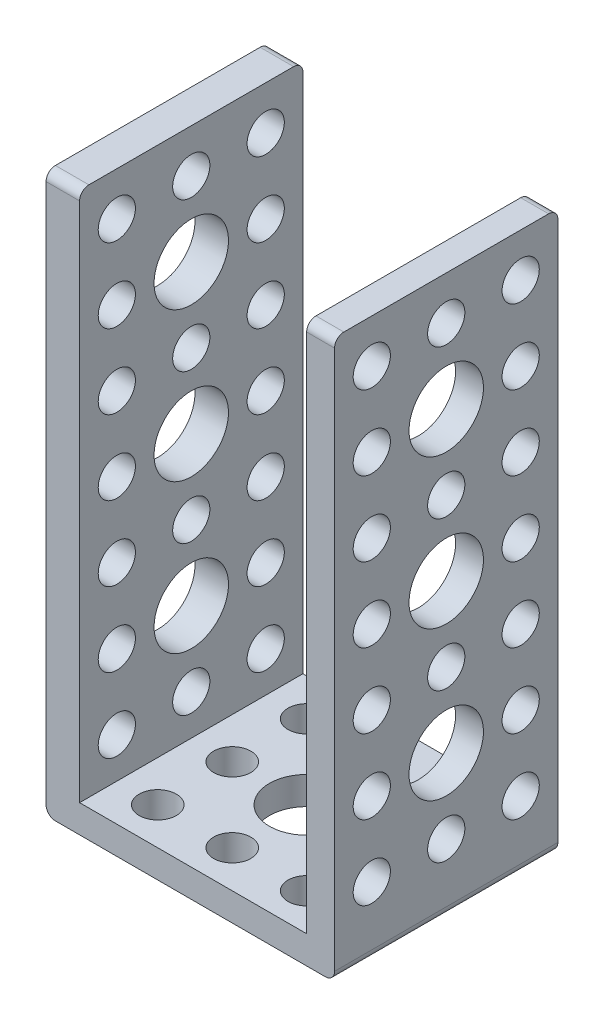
ISO-10303-21;
HEADER;
FILE_DESCRIPTION(('STEP AP214'),'2;1');
FILE_NAME('part.step','',(''),(''),'','','');
FILE_SCHEMA(('AUTOMOTIVE_DESIGN { 1 0 10303 214 1 1 1 1 }'));
ENDSEC;
DATA;
#1=APPLICATION_CONTEXT('core data for automotive mechanical design processes');
#2=APPLICATION_PROTOCOL_DEFINITION('international standard','automotive_design',2000,#1);
#3=PRODUCT_CONTEXT('',#1,'mechanical');
#4=PRODUCT('Part','Part','',(#3));
#5=PRODUCT_RELATED_PRODUCT_CATEGORY('part','',(#4));
#6=PRODUCT_DEFINITION_FORMATION('','',#4);
#7=PRODUCT_DEFINITION_CONTEXT('part definition',#1,'design');
#8=PRODUCT_DEFINITION('design','',#6,#7);
#9=PRODUCT_DEFINITION_SHAPE('','',#8);
#10=(LENGTH_UNIT() NAMED_UNIT(*) SI_UNIT(.MILLI.,.METRE.));
#11=(NAMED_UNIT(*) PLANE_ANGLE_UNIT() SI_UNIT($,.RADIAN.));
#12=(NAMED_UNIT(*) SI_UNIT($,.STERADIAN.) SOLID_ANGLE_UNIT());
#13=UNCERTAINTY_MEASURE_WITH_UNIT(LENGTH_MEASURE(1.E-05),#10,'distance_accuracy_value','');
#14=(GEOMETRIC_REPRESENTATION_CONTEXT(3) GLOBAL_UNCERTAINTY_ASSIGNED_CONTEXT((#13)) GLOBAL_UNIT_ASSIGNED_CONTEXT((#10,
#11,#12)) REPRESENTATION_CONTEXT('',''));
#15=CARTESIAN_POINT('',(0.,0.,0.));
#16=DIRECTION('',(0.,0.,1.));
#17=DIRECTION('',(1.,0.,0.));
#18=AXIS2_PLACEMENT_3D('',#15,#16,#17);
#19=CARTESIAN_POINT('',(-3.60101010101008,36.010101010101,24.));
#20=DIRECTION('',(1.,0.,0.));
#21=DIRECTION('',(0.,1.,0.));
#22=AXIS2_PLACEMENT_3D('',#19,#20,#21);
#23=PLANE('',#22);
#24=CARTESIAN_POINT('',(-3.60101010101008,7.33950415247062,4.00000000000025));
#25=DIRECTION('',(-1.,0.,0.));
#26=DIRECTION('',(0.,-1.,0.));
#27=AXIS2_PLACEMENT_3D('',#24,#25,#26);
#28=CIRCLE('',#27,2.);
#29=CARTESIAN_POINT('',(-3.60101010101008,5.33950415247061,4.00000000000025));
#30=VERTEX_POINT('',#29);
#31=EDGE_CURVE('E516',#30,#30,#28,.T.);
#32=ORIENTED_EDGE('',*,*,#31,.F.);
#33=EDGE_LOOP('',(#32));
#34=FACE_BOUND('',#33,.T.);
#35=CARTESIAN_POINT('',(-3.60101010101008,7.33950415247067,20.0000000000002));
#36=DIRECTION('',(-1.,0.,0.));
#37=DIRECTION('',(0.,-1.,0.));
#38=AXIS2_PLACEMENT_3D('',#35,#36,#37);
#39=CIRCLE('',#38,2.);
#40=CARTESIAN_POINT('',(-3.60101010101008,5.33950415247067,20.0000000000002));
#41=VERTEX_POINT('',#40);
#42=EDGE_CURVE('E523',#41,#41,#39,.T.);
#43=ORIENTED_EDGE('',*,*,#42,.F.);
#44=EDGE_LOOP('',(#43));
#45=FACE_BOUND('',#44,.T.);
#46=CARTESIAN_POINT('',(-3.60101010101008,-8.66049584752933,12.0000000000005));
#47=DIRECTION('',(-1.,0.,0.));
#48=DIRECTION('',(0.,-1.,0.));
#49=AXIS2_PLACEMENT_3D('',#46,#47,#48);
#50=CIRCLE('',#49,4.);
#51=CARTESIAN_POINT('',(-3.60101010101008,-12.6604958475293,12.0000000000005));
#52=VERTEX_POINT('',#51);
#53=EDGE_CURVE('E504',#52,#52,#50,.T.);
#54=ORIENTED_EDGE('',*,*,#53,.F.);
#55=EDGE_LOOP('',(#54));
#56=FACE_BOUND('',#55,.T.);
#57=CARTESIAN_POINT('',(-3.60101010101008,15.3395041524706,4.00000000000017));
#58=DIRECTION('',(-1.,0.,0.));
#59=DIRECTION('',(0.,-1.,0.));
#60=AXIS2_PLACEMENT_3D('',#57,#58,#59);
#61=CIRCLE('',#60,2.);
#62=CARTESIAN_POINT('',(-3.60101010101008,13.3395041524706,4.00000000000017));
#63=VERTEX_POINT('',#62);
#64=EDGE_CURVE('E511',#63,#63,#61,.T.);
#65=ORIENTED_EDGE('',*,*,#64,.F.);
#66=EDGE_LOOP('',(#65));
#67=FACE_BOUND('',#66,.T.);
#68=CARTESIAN_POINT('',(-3.60101010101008,-8.66049584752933,20.0000000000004));
#69=DIRECTION('',(-1.,0.,0.));
#70=DIRECTION('',(0.,-1.,0.));
#71=AXIS2_PLACEMENT_3D('',#68,#69,#70);
#72=CIRCLE('',#71,2.);
#73=CARTESIAN_POINT('',(-3.60101010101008,-10.6604958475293,20.0000000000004));
#74=VERTEX_POINT('',#73);
#75=EDGE_CURVE('E540',#74,#74,#72,.T.);
#76=ORIENTED_EDGE('',*,*,#75,.F.);
#77=EDGE_LOOP('',(#76));
#78=FACE_BOUND('',#77,.T.);
#79=CARTESIAN_POINT('',(-3.60101010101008,-0.660495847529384,4.00000000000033));
#80=DIRECTION('',(-1.,0.,0.));
#81=DIRECTION('',(0.,-1.,0.));
#82=AXIS2_PLACEMENT_3D('',#79,#80,#81);
#83=CIRCLE('',#82,2.);
#84=CARTESIAN_POINT('',(-3.60101010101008,-2.66049584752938,4.00000000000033));
#85=VERTEX_POINT('',#84);
#86=EDGE_CURVE('E547',#85,#85,#83,.T.);
#87=ORIENTED_EDGE('',*,*,#86,.F.);
#88=EDGE_LOOP('',(#87));
#89=FACE_BOUND('',#88,.T.);
#90=CARTESIAN_POINT('',(-3.60101010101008,-0.660495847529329,20.0000000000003));
#91=DIRECTION('',(-1.,0.,0.));
#92=DIRECTION('',(0.,-1.,0.));
#93=AXIS2_PLACEMENT_3D('',#90,#91,#92);
#94=CIRCLE('',#93,2.);
#95=CARTESIAN_POINT('',(-3.60101010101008,-2.66049584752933,20.0000000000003));
#96=VERTEX_POINT('',#95);
#97=EDGE_CURVE('E528',#96,#96,#94,.T.);
#98=ORIENTED_EDGE('',*,*,#97,.F.);
#99=EDGE_LOOP('',(#98));
#100=FACE_BOUND('',#99,.T.);
#101=CARTESIAN_POINT('',(-3.60101010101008,-0.660495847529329,12.0000000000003));
#102=DIRECTION('',(-1.,0.,0.));
#103=DIRECTION('',(0.,-1.,0.));
#104=AXIS2_PLACEMENT_3D('',#101,#102,#103);
#105=CIRCLE('',#104,2.);
#106=CARTESIAN_POINT('',(-3.60101010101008,-2.66049584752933,12.0000000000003));
#107=VERTEX_POINT('',#106);
#108=EDGE_CURVE('E535',#107,#107,#105,.T.);
#109=ORIENTED_EDGE('',*,*,#108,.F.);
#110=EDGE_LOOP('',(#109));
#111=FACE_BOUND('',#110,.T.);
#112=CARTESIAN_POINT('',(-3.60101010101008,7.33950415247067,12.0000000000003));
#113=DIRECTION('',(-1.,0.,0.));
#114=DIRECTION('',(0.,-1.,0.));
#115=AXIS2_PLACEMENT_3D('',#112,#113,#114);
#116=CIRCLE('',#115,4.);
#117=CARTESIAN_POINT('',(-3.60101010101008,3.33950415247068,12.0000000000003));
#118=VERTEX_POINT('',#117);
#119=EDGE_CURVE('E468',#118,#118,#116,.T.);
#120=ORIENTED_EDGE('',*,*,#119,.F.);
#121=EDGE_LOOP('',(#120));
#122=FACE_BOUND('',#121,.T.);
#123=CARTESIAN_POINT('',(-3.60101010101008,31.3395041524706,4.));
#124=DIRECTION('',(-1.,0.,0.));
#125=DIRECTION('',(0.,-1.,0.));
#126=AXIS2_PLACEMENT_3D('',#123,#124,#125);
#127=CIRCLE('',#126,2.);
#128=CARTESIAN_POINT('',(-3.60101010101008,29.3395041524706,4.));
#129=VERTEX_POINT('',#128);
#130=EDGE_CURVE('E475',#129,#129,#127,.T.);
#131=ORIENTED_EDGE('',*,*,#130,.F.);
#132=EDGE_LOOP('',(#131));
#133=FACE_BOUND('',#132,.T.);
#134=CARTESIAN_POINT('',(-3.60101010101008,31.3395041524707,20.));
#135=DIRECTION('',(-1.,0.,0.));
#136=DIRECTION('',(0.,-1.,0.));
#137=AXIS2_PLACEMENT_3D('',#134,#135,#136);
#138=CIRCLE('',#137,2.);
#139=CARTESIAN_POINT('',(-3.60101010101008,29.3395041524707,20.));
#140=VERTEX_POINT('',#139);
#141=EDGE_CURVE('E456',#140,#140,#138,.T.);
#142=ORIENTED_EDGE('',*,*,#141,.F.);
#143=EDGE_LOOP('',(#142));
#144=FACE_BOUND('',#143,.T.);
#145=CARTESIAN_POINT('',(-3.60101010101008,23.3395041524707,12.0000000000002));
#146=DIRECTION('',(-1.,0.,0.));
#147=DIRECTION('',(0.,-1.,0.));
#148=AXIS2_PLACEMENT_3D('',#145,#146,#147);
#149=CIRCLE('',#148,4.);
#150=CARTESIAN_POINT('',(-3.60101010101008,19.3395041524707,12.0000000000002));
#151=VERTEX_POINT('',#150);
#152=EDGE_CURVE('E463',#151,#151,#149,.T.);
#153=ORIENTED_EDGE('',*,*,#152,.F.);
#154=EDGE_LOOP('',(#153));
#155=FACE_BOUND('',#154,.T.);
#156=CARTESIAN_POINT('',(-3.60101010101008,23.3395041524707,20.0000000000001));
#157=DIRECTION('',(-1.,0.,0.));
#158=DIRECTION('',(0.,-1.,0.));
#159=AXIS2_PLACEMENT_3D('',#156,#157,#158);
#160=CIRCLE('',#159,2.);
#161=CARTESIAN_POINT('',(-3.60101010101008,21.3395041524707,20.0000000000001));
#162=VERTEX_POINT('',#161);
#163=EDGE_CURVE('E499',#162,#162,#160,.T.);
#164=ORIENTED_EDGE('',*,*,#163,.F.);
#165=EDGE_LOOP('',(#164));
#166=FACE_BOUND('',#165,.T.);
#167=CARTESIAN_POINT('',(-3.60101010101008,23.3395041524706,4.00000000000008));
#168=DIRECTION('',(-1.,0.,0.));
#169=DIRECTION('',(0.,-1.,0.));
#170=AXIS2_PLACEMENT_3D('',#167,#168,#169);
#171=CIRCLE('',#170,2.);
#172=CARTESIAN_POINT('',(-3.60101010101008,21.3395041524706,4.00000000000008));
#173=VERTEX_POINT('',#172);
#174=EDGE_CURVE('E493',#173,#173,#171,.T.);
#175=ORIENTED_EDGE('',*,*,#174,.F.);
#176=EDGE_LOOP('',(#175));
#177=FACE_BOUND('',#176,.T.);
#178=CARTESIAN_POINT('',(-3.60101010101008,15.3395041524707,12.0000000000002));
#179=DIRECTION('',(-1.,0.,0.));
#180=DIRECTION('',(0.,-1.,0.));
#181=AXIS2_PLACEMENT_3D('',#178,#179,#180);
#182=CIRCLE('',#181,2.);
#183=CARTESIAN_POINT('',(-3.60101010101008,13.3395041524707,12.0000000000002));
#184=VERTEX_POINT('',#183);
#185=EDGE_CURVE('E487',#184,#184,#182,.T.);
#186=ORIENTED_EDGE('',*,*,#185,.F.);
#187=EDGE_LOOP('',(#186));
#188=FACE_BOUND('',#187,.T.);
#189=CARTESIAN_POINT('',(-3.60101010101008,15.3395041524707,20.0000000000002));
#190=DIRECTION('',(-1.,0.,0.));
#191=DIRECTION('',(0.,-1.,0.));
#192=AXIS2_PLACEMENT_3D('',#189,#190,#191);
#193=CIRCLE('',#192,2.);
#194=CARTESIAN_POINT('',(-3.60101010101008,13.3395041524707,20.0000000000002));
#195=VERTEX_POINT('',#194);
#196=EDGE_CURVE('E480',#195,#195,#193,.T.);
#197=ORIENTED_EDGE('',*,*,#196,.F.);
#198=EDGE_LOOP('',(#197));
#199=FACE_BOUND('',#198,.T.);
#200=CARTESIAN_POINT('',(-3.60101010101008,-16.6604958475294,4.0000000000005));
#201=DIRECTION('',(-1.,0.,0.));
#202=DIRECTION('',(0.,-1.,0.));
#203=AXIS2_PLACEMENT_3D('',#200,#201,#202);
#204=CIRCLE('',#203,2.);
#205=CARTESIAN_POINT('',(-3.60101010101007,-18.6604958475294,4.0000000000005));
#206=VERTEX_POINT('',#205);
#207=EDGE_CURVE('E564',#206,#206,#204,.T.);
#208=ORIENTED_EDGE('',*,*,#207,.F.);
#209=EDGE_LOOP('',(#208));
#210=FACE_BOUND('',#209,.T.);
#211=CARTESIAN_POINT('',(-3.60101010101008,-16.6604958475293,20.0000000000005));
#212=DIRECTION('',(-1.,0.,0.));
#213=DIRECTION('',(0.,-1.,0.));
#214=AXIS2_PLACEMENT_3D('',#211,#212,#213);
#215=CIRCLE('',#214,2.);
#216=CARTESIAN_POINT('',(-3.60101010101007,-18.6604958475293,20.0000000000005));
#217=VERTEX_POINT('',#216);
#218=EDGE_CURVE('E570',#217,#217,#215,.T.);
#219=ORIENTED_EDGE('',*,*,#218,.F.);
#220=EDGE_LOOP('',(#219));
#221=FACE_BOUND('',#220,.T.);
#222=CARTESIAN_POINT('',(-3.60101010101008,-16.6604958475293,12.0000000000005));
#223=DIRECTION('',(-1.,0.,0.));
#224=DIRECTION('',(0.,-1.,0.));
#225=AXIS2_PLACEMENT_3D('',#222,#223,#224);
#226=CIRCLE('',#225,2.);
#227=CARTESIAN_POINT('',(-3.60101010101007,-18.6604958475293,12.0000000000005));
#228=VERTEX_POINT('',#227);
#229=EDGE_CURVE('E552',#228,#228,#226,.T.);
#230=ORIENTED_EDGE('',*,*,#229,.F.);
#231=EDGE_LOOP('',(#230));
#232=FACE_BOUND('',#231,.T.);
#233=CARTESIAN_POINT('',(-3.60101010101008,-8.66049584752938,4.00000000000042));
#234=DIRECTION('',(-1.,0.,0.));
#235=DIRECTION('',(0.,-1.,0.));
#236=AXIS2_PLACEMENT_3D('',#233,#234,#235);
#237=CIRCLE('',#236,2.);
#238=CARTESIAN_POINT('',(-3.60101010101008,-10.6604958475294,4.00000000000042));
#239=VERTEX_POINT('',#238);
#240=EDGE_CURVE('E559',#239,#239,#237,.T.);
#241=ORIENTED_EDGE('',*,*,#240,.F.);
#242=EDGE_LOOP('',(#241));
#243=FACE_BOUND('',#242,.T.);
#244=CARTESIAN_POINT('',(-3.60101010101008,31.3395041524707,12.));
#245=DIRECTION('',(-1.,0.,0.));
#246=DIRECTION('',(0.,-1.,0.));
#247=AXIS2_PLACEMENT_3D('',#244,#245,#246);
#248=CIRCLE('',#247,2.);
#249=CARTESIAN_POINT('',(-3.60101010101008,29.3395041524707,12.));
#250=VERTEX_POINT('',#249);
#251=EDGE_CURVE('E450',#250,#250,#248,.T.);
#252=ORIENTED_EDGE('',*,*,#251,.F.);
#253=EDGE_LOOP('',(#252));
#254=FACE_BOUND('',#253,.T.);
#255=DIRECTION('',(0.,-1.,0.));
#256=VECTOR('',#255,1.);
#257=CARTESIAN_POINT('',(-3.60101010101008,36.010101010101,0.));
#258=LINE('',#257,#256);
#259=CARTESIAN_POINT('',(-3.60101010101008,35.010101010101,0.));
#260=VERTEX_POINT('',#259);
#261=CARTESIAN_POINT('',(-3.60101010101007,-22.989898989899,0.));
#262=VERTEX_POINT('',#261);
#263=EDGE_CURVE('E167',#260,#262,#258,.T.);
#264=ORIENTED_EDGE('',*,*,#263,.T.);
#265=DIRECTION('',(0.,0.,-1.));
#266=VECTOR('',#265,1.);
#267=CARTESIAN_POINT('',(-3.60101010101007,-22.989898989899,24.));
#268=LINE('',#267,#266);
#269=CARTESIAN_POINT('',(-3.60101010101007,-22.989898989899,24.));
#270=VERTEX_POINT('',#269);
#271=EDGE_CURVE('E294',#262,#270,#268,.F.);
#272=ORIENTED_EDGE('',*,*,#271,.T.);
#273=DIRECTION('',(0.,-1.,0.));
#274=VECTOR('',#273,1.);
#275=CARTESIAN_POINT('',(-3.60101010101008,36.010101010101,24.));
#276=LINE('',#275,#274);
#277=CARTESIAN_POINT('',(-3.60101010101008,35.010101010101,24.));
#278=VERTEX_POINT('',#277);
#279=EDGE_CURVE('E182',#278,#270,#276,.T.);
#280=ORIENTED_EDGE('',*,*,#279,.F.);
#281=CARTESIAN_POINT('',(-3.60101010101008,35.010101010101,23.));
#282=DIRECTION('',(1.,0.,0.));
#283=DIRECTION('',(0.,1.,0.));
#284=AXIS2_PLACEMENT_3D('',#281,#282,#283);
#285=CIRCLE('',#284,1.);
#286=CARTESIAN_POINT('',(-3.60101010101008,36.010101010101,23.));
#287=VERTEX_POINT('',#286);
#288=EDGE_CURVE('E290',#278,#287,#285,.F.);
#289=ORIENTED_EDGE('',*,*,#288,.T.);
#290=DIRECTION('',(0.,0.,-1.));
#291=VECTOR('',#290,1.);
#292=CARTESIAN_POINT('',(-3.60101010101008,36.010101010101,24.));
#293=LINE('',#292,#291);
#294=CARTESIAN_POINT('',(-3.60101010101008,36.010101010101,1.));
#295=VERTEX_POINT('',#294);
#296=EDGE_CURVE('E163',#287,#295,#293,.T.);
#297=ORIENTED_EDGE('',*,*,#296,.T.);
#298=CARTESIAN_POINT('',(-3.60101010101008,35.010101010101,1.));
#299=DIRECTION('',(1.,0.,0.));
#300=DIRECTION('',(0.,1.,0.));
#301=AXIS2_PLACEMENT_3D('',#298,#299,#300);
#302=CIRCLE('',#301,1.);
#303=EDGE_CURVE('E292',#295,#260,#302,.F.);
#304=ORIENTED_EDGE('',*,*,#303,.T.);
#305=EDGE_LOOP('',(#264,#272,#280,#289,#297,#304));
#306=FACE_BOUND('',#305,.T.);
#307=ADVANCED_FACE('F32',(#34,#45,#56,#67,#78,#89,#100,#111,#122,#133,#144,#155,#166,#177,#188,
#199,#210,#221,#232,#243,#254,#306),#23,.F.);
#308=CARTESIAN_POINT('',(-3.60101010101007,-23.989898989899,24.));
#309=DIRECTION('',(0.,1.,0.));
#310=DIRECTION('',(-1.,0.,0.));
#311=AXIS2_PLACEMENT_3D('',#308,#309,#310);
#312=PLANE('',#311);
#313=CARTESIAN_POINT('',(12.3989898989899,-23.989898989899,4.00000000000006));
#314=DIRECTION('',(0.,1.,0.));
#315=DIRECTION('',(-1.,0.,0.));
#316=AXIS2_PLACEMENT_3D('',#313,#314,#315);
#317=CIRCLE('',#316,2.);
#318=CARTESIAN_POINT('',(10.3989898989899,-23.989898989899,4.00000000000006));
#319=VERTEX_POINT('',#318);
#320=EDGE_CURVE('E380',#319,#319,#317,.T.);
#321=ORIENTED_EDGE('',*,*,#320,.T.);
#322=EDGE_LOOP('',(#321));
#323=FACE_BOUND('',#322,.T.);
#324=CARTESIAN_POINT('',(20.3989898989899,-23.989898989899,12.));
#325=DIRECTION('',(0.,1.,0.));
#326=DIRECTION('',(-1.,0.,0.));
#327=AXIS2_PLACEMENT_3D('',#324,#325,#326);
#328=CIRCLE('',#327,2.);
#329=CARTESIAN_POINT('',(18.3989898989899,-23.989898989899,12.));
#330=VERTEX_POINT('',#329);
#331=EDGE_CURVE('E374',#330,#330,#328,.T.);
#332=ORIENTED_EDGE('',*,*,#331,.T.);
#333=EDGE_LOOP('',(#332));
#334=FACE_BOUND('',#333,.T.);
#335=CARTESIAN_POINT('',(20.3989898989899,-23.989898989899,20.));
#336=DIRECTION('',(0.,1.,0.));
#337=DIRECTION('',(-1.,0.,0.));
#338=AXIS2_PLACEMENT_3D('',#335,#336,#337);
#339=CIRCLE('',#338,2.);
#340=CARTESIAN_POINT('',(18.3989898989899,-23.989898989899,20.));
#341=VERTEX_POINT('',#340);
#342=EDGE_CURVE('E368',#341,#341,#339,.T.);
#343=ORIENTED_EDGE('',*,*,#342,.T.);
#344=EDGE_LOOP('',(#343));
#345=FACE_BOUND('',#344,.T.);
#346=CARTESIAN_POINT('',(12.3989898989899,-23.989898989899,20.0000000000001));
#347=DIRECTION('',(0.,1.,0.));
#348=DIRECTION('',(-1.,0.,0.));
#349=AXIS2_PLACEMENT_3D('',#346,#347,#348);
#350=CIRCLE('',#349,2.);
#351=CARTESIAN_POINT('',(10.3989898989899,-23.989898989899,20.0000000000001));
#352=VERTEX_POINT('',#351);
#353=EDGE_CURVE('E361',#352,#352,#350,.T.);
#354=ORIENTED_EDGE('',*,*,#353,.T.);
#355=EDGE_LOOP('',(#354));
#356=FACE_BOUND('',#355,.T.);
#357=CARTESIAN_POINT('',(4.39898989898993,-23.989898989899,20.0000000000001));
#358=DIRECTION('',(0.,1.,0.));
#359=DIRECTION('',(-1.,0.,0.));
#360=AXIS2_PLACEMENT_3D('',#357,#358,#359);
#361=CIRCLE('',#360,2.);
#362=CARTESIAN_POINT('',(2.39898989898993,-23.989898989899,20.0000000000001));
#363=VERTEX_POINT('',#362);
#364=EDGE_CURVE('E397',#363,#363,#361,.T.);
#365=ORIENTED_EDGE('',*,*,#364,.T.);
#366=EDGE_LOOP('',(#365));
#367=FACE_BOUND('',#366,.T.);
#368=CARTESIAN_POINT('',(20.3989898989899,-23.989898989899,4.));
#369=DIRECTION('',(0.,1.,0.));
#370=DIRECTION('',(-1.,0.,0.));
#371=AXIS2_PLACEMENT_3D('',#368,#369,#370);
#372=CIRCLE('',#371,2.);
#373=CARTESIAN_POINT('',(18.3989898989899,-23.989898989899,4.));
#374=VERTEX_POINT('',#373);
#375=EDGE_CURVE('E403',#374,#374,#372,.T.);
#376=ORIENTED_EDGE('',*,*,#375,.T.);
#377=EDGE_LOOP('',(#376));
#378=FACE_BOUND('',#377,.T.);
#379=CARTESIAN_POINT('',(12.3989898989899,-23.989898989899,12.));
#380=DIRECTION('',(0.,1.,0.));
#381=DIRECTION('',(-1.,0.,0.));
#382=AXIS2_PLACEMENT_3D('',#379,#380,#381);
#383=CIRCLE('',#382,4.);
#384=CARTESIAN_POINT('',(8.39898989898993,-23.989898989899,12.));
#385=VERTEX_POINT('',#384);
#386=EDGE_CURVE('E385',#385,#385,#383,.T.);
#387=ORIENTED_EDGE('',*,*,#386,.T.);
#388=EDGE_LOOP('',(#387));
#389=FACE_BOUND('',#388,.T.);
#390=CARTESIAN_POINT('',(4.39898989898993,-23.989898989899,12.0000000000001));
#391=DIRECTION('',(0.,1.,0.));
#392=DIRECTION('',(-1.,0.,0.));
#393=AXIS2_PLACEMENT_3D('',#390,#391,#392);
#394=CIRCLE('',#393,2.);
#395=CARTESIAN_POINT('',(2.39898989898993,-23.989898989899,12.0000000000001));
#396=VERTEX_POINT('',#395);
#397=EDGE_CURVE('E392',#396,#396,#394,.T.);
#398=ORIENTED_EDGE('',*,*,#397,.T.);
#399=EDGE_LOOP('',(#398));
#400=FACE_BOUND('',#399,.T.);
#401=CARTESIAN_POINT('',(4.39898989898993,-23.989898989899,4.00000000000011));
#402=DIRECTION('',(0.,1.,0.));
#403=DIRECTION('',(-1.,0.,0.));
#404=AXIS2_PLACEMENT_3D('',#401,#402,#403);
#405=CIRCLE('',#404,2.);
#406=CARTESIAN_POINT('',(2.39898989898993,-23.989898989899,4.00000000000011));
#407=VERTEX_POINT('',#406);
#408=EDGE_CURVE('E171',#407,#407,#405,.T.);
#409=ORIENTED_EDGE('',*,*,#408,.T.);
#410=EDGE_LOOP('',(#409));
#411=FACE_BOUND('',#410,.T.);
#412=DIRECTION('',(1.,0.,0.));
#413=VECTOR('',#412,1.);
#414=CARTESIAN_POINT('',(-3.60101010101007,-23.989898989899,24.));
#415=LINE('',#414,#413);
#416=CARTESIAN_POINT('',(-2.60101010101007,-23.989898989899,24.));
#417=VERTEX_POINT('',#416);
#418=CARTESIAN_POINT('',(26.3989898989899,-23.989898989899,24.));
#419=VERTEX_POINT('',#418);
#420=EDGE_CURVE('E350',#417,#419,#415,.T.);
#421=ORIENTED_EDGE('',*,*,#420,.F.);
#422=DIRECTION('',(0.,0.,-1.));
#423=VECTOR('',#422,1.);
#424=CARTESIAN_POINT('',(-2.60101010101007,-23.989898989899,24.));
#425=LINE('',#424,#423);
#426=CARTESIAN_POINT('',(-2.60101010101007,-23.989898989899,0.));
#427=VERTEX_POINT('',#426);
#428=EDGE_CURVE('E279',#417,#427,#425,.T.);
#429=ORIENTED_EDGE('',*,*,#428,.T.);
#430=DIRECTION('',(1.,0.,0.));
#431=VECTOR('',#430,1.);
#432=CARTESIAN_POINT('',(-3.60101010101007,-23.989898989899,0.));
#433=LINE('',#432,#431);
#434=CARTESIAN_POINT('',(26.3989898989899,-23.989898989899,0.));
#435=VERTEX_POINT('',#434);
#436=EDGE_CURVE('E170',#427,#435,#433,.T.);
#437=ORIENTED_EDGE('',*,*,#436,.T.);
#438=DIRECTION('',(0.,0.,-1.));
#439=VECTOR('',#438,1.);
#440=CARTESIAN_POINT('',(26.3989898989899,-23.989898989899,24.));
#441=LINE('',#440,#439);
#442=EDGE_CURVE('E192',#435,#419,#441,.F.);
#443=ORIENTED_EDGE('',*,*,#442,.T.);
#444=EDGE_LOOP('',(#421,#429,#437,#443));
#445=FACE_BOUND('',#444,.T.);
#446=ADVANCED_FACE('F347',(#323,#334,#345,#356,#367,#378,#389,#400,#411,#445),#312,.F.);
#447=CARTESIAN_POINT('',(27.3989898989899,-23.989898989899,24.));
#448=DIRECTION('',(-1.,0.,0.));
#449=DIRECTION('',(0.,0.,1.));
#450=AXIS2_PLACEMENT_3D('',#447,#448,#449);
#451=PLANE('',#450);
#452=CARTESIAN_POINT('',(27.3989898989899,7.33950415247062,4.00000000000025));
#453=DIRECTION('',(-1.,0.,0.));
#454=DIRECTION('',(0.,-1.,0.));
#455=AXIS2_PLACEMENT_3D('',#452,#453,#454);
#456=CIRCLE('',#455,2.);
#457=CARTESIAN_POINT('',(27.3989898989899,5.33950415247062,4.00000000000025));
#458=VERTEX_POINT('',#457);
#459=EDGE_CURVE('E519',#458,#458,#456,.T.);
#460=ORIENTED_EDGE('',*,*,#459,.T.);
#461=EDGE_LOOP('',(#460));
#462=FACE_BOUND('',#461,.T.);
#463=CARTESIAN_POINT('',(27.3989898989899,7.33950415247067,20.0000000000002));
#464=DIRECTION('',(-1.,0.,0.));
#465=DIRECTION('',(0.,-1.,0.));
#466=AXIS2_PLACEMENT_3D('',#463,#464,#465);
#467=CIRCLE('',#466,2.);
#468=CARTESIAN_POINT('',(27.3989898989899,5.33950415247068,20.0000000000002));
#469=VERTEX_POINT('',#468);
#470=EDGE_CURVE('E508',#469,#469,#467,.T.);
#471=ORIENTED_EDGE('',*,*,#470,.T.);
#472=EDGE_LOOP('',(#471));
#473=FACE_BOUND('',#472,.T.);
#474=CARTESIAN_POINT('',(27.3989898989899,-8.66049584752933,12.0000000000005));
#475=DIRECTION('',(-1.,0.,0.));
#476=DIRECTION('',(0.,-1.,0.));
#477=AXIS2_PLACEMENT_3D('',#474,#475,#476);
#478=CIRCLE('',#477,4.);
#479=CARTESIAN_POINT('',(27.3989898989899,-12.6604958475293,12.0000000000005));
#480=VERTEX_POINT('',#479);
#481=EDGE_CURVE('E507',#480,#480,#478,.T.);
#482=ORIENTED_EDGE('',*,*,#481,.T.);
#483=EDGE_LOOP('',(#482));
#484=FACE_BOUND('',#483,.T.);
#485=CARTESIAN_POINT('',(27.3989898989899,15.3395041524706,4.00000000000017));
#486=DIRECTION('',(-1.,0.,0.));
#487=DIRECTION('',(0.,-1.,0.));
#488=AXIS2_PLACEMENT_3D('',#485,#486,#487);
#489=CIRCLE('',#488,2.);
#490=CARTESIAN_POINT('',(27.3989898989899,13.3395041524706,4.00000000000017));
#491=VERTEX_POINT('',#490);
#492=EDGE_CURVE('E484',#491,#491,#489,.T.);
#493=ORIENTED_EDGE('',*,*,#492,.T.);
#494=EDGE_LOOP('',(#493));
#495=FACE_BOUND('',#494,.T.);
#496=CARTESIAN_POINT('',(27.3989898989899,-8.66049584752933,20.0000000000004));
#497=DIRECTION('',(-1.,0.,0.));
#498=DIRECTION('',(0.,-1.,0.));
#499=AXIS2_PLACEMENT_3D('',#496,#497,#498);
#500=CIRCLE('',#499,2.);
#501=CARTESIAN_POINT('',(27.3989898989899,-10.6604958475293,20.0000000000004));
#502=VERTEX_POINT('',#501);
#503=EDGE_CURVE('E543',#502,#502,#500,.T.);
#504=ORIENTED_EDGE('',*,*,#503,.T.);
#505=EDGE_LOOP('',(#504));
#506=FACE_BOUND('',#505,.T.);
#507=CARTESIAN_POINT('',(27.3989898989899,-0.660495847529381,4.00000000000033));
#508=DIRECTION('',(-1.,0.,0.));
#509=DIRECTION('',(0.,-1.,0.));
#510=AXIS2_PLACEMENT_3D('',#507,#508,#509);
#511=CIRCLE('',#510,2.);
#512=CARTESIAN_POINT('',(27.3989898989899,-2.66049584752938,4.00000000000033));
#513=VERTEX_POINT('',#512);
#514=EDGE_CURVE('E532',#513,#513,#511,.T.);
#515=ORIENTED_EDGE('',*,*,#514,.T.);
#516=EDGE_LOOP('',(#515));
#517=FACE_BOUND('',#516,.T.);
#518=CARTESIAN_POINT('',(27.3989898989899,-0.660495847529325,20.0000000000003));
#519=DIRECTION('',(-1.,0.,0.));
#520=DIRECTION('',(0.,-1.,0.));
#521=AXIS2_PLACEMENT_3D('',#518,#519,#520);
#522=CIRCLE('',#521,2.);
#523=CARTESIAN_POINT('',(27.3989898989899,-2.66049584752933,20.0000000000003));
#524=VERTEX_POINT('',#523);
#525=EDGE_CURVE('E531',#524,#524,#522,.T.);
#526=ORIENTED_EDGE('',*,*,#525,.T.);
#527=EDGE_LOOP('',(#526));
#528=FACE_BOUND('',#527,.T.);
#529=CARTESIAN_POINT('',(27.3989898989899,-0.660495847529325,12.0000000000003));
#530=DIRECTION('',(-1.,0.,0.));
#531=DIRECTION('',(0.,-1.,0.));
#532=AXIS2_PLACEMENT_3D('',#529,#530,#531);
#533=CIRCLE('',#532,2.);
#534=CARTESIAN_POINT('',(27.3989898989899,-2.66049584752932,12.0000000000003));
#535=VERTEX_POINT('',#534);
#536=EDGE_CURVE('E520',#535,#535,#533,.T.);
#537=ORIENTED_EDGE('',*,*,#536,.T.);
#538=EDGE_LOOP('',(#537));
#539=FACE_BOUND('',#538,.T.);
#540=CARTESIAN_POINT('',(27.3989898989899,7.33950415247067,12.0000000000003));
#541=DIRECTION('',(-1.,0.,0.));
#542=DIRECTION('',(0.,-1.,0.));
#543=AXIS2_PLACEMENT_3D('',#540,#541,#542);
#544=CIRCLE('',#543,4.);
#545=CARTESIAN_POINT('',(27.3989898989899,3.33950415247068,12.0000000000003));
#546=VERTEX_POINT('',#545);
#547=EDGE_CURVE('E471',#546,#546,#544,.T.);
#548=ORIENTED_EDGE('',*,*,#547,.T.);
#549=EDGE_LOOP('',(#548));
#550=FACE_BOUND('',#549,.T.);
#551=CARTESIAN_POINT('',(27.3989898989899,31.3395041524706,4.));
#552=DIRECTION('',(-1.,0.,0.));
#553=DIRECTION('',(0.,-1.,0.));
#554=AXIS2_PLACEMENT_3D('',#551,#552,#553);
#555=CIRCLE('',#554,2.);
#556=CARTESIAN_POINT('',(27.3989898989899,29.3395041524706,4.));
#557=VERTEX_POINT('',#556);
#558=EDGE_CURVE('E460',#557,#557,#555,.T.);
#559=ORIENTED_EDGE('',*,*,#558,.T.);
#560=EDGE_LOOP('',(#559));
#561=FACE_BOUND('',#560,.T.);
#562=CARTESIAN_POINT('',(27.3989898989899,31.3395041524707,20.));
#563=DIRECTION('',(-1.,0.,0.));
#564=DIRECTION('',(0.,-1.,0.));
#565=AXIS2_PLACEMENT_3D('',#562,#563,#564);
#566=CIRCLE('',#565,2.);
#567=CARTESIAN_POINT('',(27.3989898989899,29.3395041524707,20.));
#568=VERTEX_POINT('',#567);
#569=EDGE_CURVE('E459',#568,#568,#566,.T.);
#570=ORIENTED_EDGE('',*,*,#569,.T.);
#571=EDGE_LOOP('',(#570));
#572=FACE_BOUND('',#571,.T.);
#573=CARTESIAN_POINT('',(27.3989898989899,23.3395041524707,12.0000000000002));
#574=DIRECTION('',(-1.,0.,0.));
#575=DIRECTION('',(0.,-1.,0.));
#576=AXIS2_PLACEMENT_3D('',#573,#574,#575);
#577=CIRCLE('',#576,4.);
#578=CARTESIAN_POINT('',(27.3989898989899,19.3395041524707,12.0000000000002));
#579=VERTEX_POINT('',#578);
#580=EDGE_CURVE('E453',#579,#579,#577,.T.);
#581=ORIENTED_EDGE('',*,*,#580,.T.);
#582=EDGE_LOOP('',(#581));
#583=FACE_BOUND('',#582,.T.);
#584=CARTESIAN_POINT('',(27.3989898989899,23.3395041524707,20.0000000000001));
#585=DIRECTION('',(-1.,0.,0.));
#586=DIRECTION('',(0.,-1.,0.));
#587=AXIS2_PLACEMENT_3D('',#584,#585,#586);
#588=CIRCLE('',#587,2.);
#589=CARTESIAN_POINT('',(27.3989898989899,21.3395041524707,20.0000000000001));
#590=VERTEX_POINT('',#589);
#591=EDGE_CURVE('E472',#590,#590,#588,.T.);
#592=ORIENTED_EDGE('',*,*,#591,.T.);
#593=EDGE_LOOP('',(#592));
#594=FACE_BOUND('',#593,.T.);
#595=CARTESIAN_POINT('',(27.3989898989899,23.3395041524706,4.00000000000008));
#596=DIRECTION('',(-1.,0.,0.));
#597=DIRECTION('',(0.,-1.,0.));
#598=AXIS2_PLACEMENT_3D('',#595,#596,#597);
#599=CIRCLE('',#598,2.);
#600=CARTESIAN_POINT('',(27.3989898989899,21.3395041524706,4.00000000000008));
#601=VERTEX_POINT('',#600);
#602=EDGE_CURVE('E496',#601,#601,#599,.T.);
#603=ORIENTED_EDGE('',*,*,#602,.T.);
#604=EDGE_LOOP('',(#603));
#605=FACE_BOUND('',#604,.T.);
#606=CARTESIAN_POINT('',(27.3989898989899,15.3395041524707,12.0000000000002));
#607=DIRECTION('',(-1.,0.,0.));
#608=DIRECTION('',(0.,-1.,0.));
#609=AXIS2_PLACEMENT_3D('',#606,#607,#608);
#610=CIRCLE('',#609,2.);
#611=CARTESIAN_POINT('',(27.3989898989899,13.3395041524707,12.0000000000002));
#612=VERTEX_POINT('',#611);
#613=EDGE_CURVE('E490',#612,#612,#610,.T.);
#614=ORIENTED_EDGE('',*,*,#613,.T.);
#615=EDGE_LOOP('',(#614));
#616=FACE_BOUND('',#615,.T.);
#617=CARTESIAN_POINT('',(27.3989898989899,15.3395041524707,20.0000000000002));
#618=DIRECTION('',(-1.,0.,0.));
#619=DIRECTION('',(0.,-1.,0.));
#620=AXIS2_PLACEMENT_3D('',#617,#618,#619);
#621=CIRCLE('',#620,2.);
#622=CARTESIAN_POINT('',(27.3989898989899,13.3395041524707,20.0000000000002));
#623=VERTEX_POINT('',#622);
#624=EDGE_CURVE('E483',#623,#623,#621,.T.);
#625=ORIENTED_EDGE('',*,*,#624,.T.);
#626=EDGE_LOOP('',(#625));
#627=FACE_BOUND('',#626,.T.);
#628=CARTESIAN_POINT('',(27.3989898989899,-16.6604958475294,4.0000000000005));
#629=DIRECTION('',(-1.,0.,0.));
#630=DIRECTION('',(0.,-1.,0.));
#631=AXIS2_PLACEMENT_3D('',#628,#629,#630);
#632=CIRCLE('',#631,2.);
#633=CARTESIAN_POINT('',(27.3989898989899,-18.6604958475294,4.0000000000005));
#634=VERTEX_POINT('',#633);
#635=EDGE_CURVE('E567',#634,#634,#632,.T.);
#636=ORIENTED_EDGE('',*,*,#635,.T.);
#637=EDGE_LOOP('',(#636));
#638=FACE_BOUND('',#637,.T.);
#639=CARTESIAN_POINT('',(27.3989898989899,-16.6604958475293,20.0000000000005));
#640=DIRECTION('',(-1.,0.,0.));
#641=DIRECTION('',(0.,-1.,0.));
#642=AXIS2_PLACEMENT_3D('',#639,#640,#641);
#643=CIRCLE('',#642,2.);
#644=CARTESIAN_POINT('',(27.3989898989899,-18.6604958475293,20.0000000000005));
#645=VERTEX_POINT('',#644);
#646=EDGE_CURVE('E556',#645,#645,#643,.T.);
#647=ORIENTED_EDGE('',*,*,#646,.T.);
#648=EDGE_LOOP('',(#647));
#649=FACE_BOUND('',#648,.T.);
#650=CARTESIAN_POINT('',(27.3989898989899,-16.6604958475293,12.0000000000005));
#651=DIRECTION('',(-1.,0.,0.));
#652=DIRECTION('',(0.,-1.,0.));
#653=AXIS2_PLACEMENT_3D('',#650,#651,#652);
#654=CIRCLE('',#653,2.);
#655=CARTESIAN_POINT('',(27.3989898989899,-18.6604958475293,12.0000000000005));
#656=VERTEX_POINT('',#655);
#657=EDGE_CURVE('E555',#656,#656,#654,.T.);
#658=ORIENTED_EDGE('',*,*,#657,.T.);
#659=EDGE_LOOP('',(#658));
#660=FACE_BOUND('',#659,.T.);
#661=CARTESIAN_POINT('',(27.3989898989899,-8.66049584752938,4.00000000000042));
#662=DIRECTION('',(-1.,0.,0.));
#663=DIRECTION('',(0.,-1.,0.));
#664=AXIS2_PLACEMENT_3D('',#661,#662,#663);
#665=CIRCLE('',#664,2.);
#666=CARTESIAN_POINT('',(27.3989898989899,-10.6604958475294,4.00000000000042));
#667=VERTEX_POINT('',#666);
#668=EDGE_CURVE('E544',#667,#667,#665,.T.);
#669=ORIENTED_EDGE('',*,*,#668,.T.);
#670=EDGE_LOOP('',(#669));
#671=FACE_BOUND('',#670,.T.);
#672=CARTESIAN_POINT('',(27.3989898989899,31.3395041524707,12.));
#673=DIRECTION('',(-1.,0.,0.));
#674=DIRECTION('',(0.,-1.,0.));
#675=AXIS2_PLACEMENT_3D('',#672,#673,#674);
#676=CIRCLE('',#675,2.);
#677=CARTESIAN_POINT('',(27.3989898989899,29.3395041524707,12.));
#678=VERTEX_POINT('',#677);
#679=EDGE_CURVE('E197',#678,#678,#676,.T.);
#680=ORIENTED_EDGE('',*,*,#679,.T.);
#681=EDGE_LOOP('',(#680));
#682=FACE_BOUND('',#681,.T.);
#683=DIRECTION('',(0.,1.,0.));
#684=VECTOR('',#683,1.);
#685=CARTESIAN_POINT('',(27.3989898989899,-23.989898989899,24.));
#686=LINE('',#685,#684);
#687=CARTESIAN_POINT('',(27.3989898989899,-22.989898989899,24.));
#688=VERTEX_POINT('',#687);
#689=CARTESIAN_POINT('',(27.3989898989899,35.010101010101,24.));
#690=VERTEX_POINT('',#689);
#691=EDGE_CURVE('E145',#688,#690,#686,.T.);
#692=ORIENTED_EDGE('',*,*,#691,.F.);
#693=DIRECTION('',(0.,0.,-1.));
#694=VECTOR('',#693,1.);
#695=CARTESIAN_POINT('',(27.3989898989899,-22.989898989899,24.));
#696=LINE('',#695,#694);
#697=CARTESIAN_POINT('',(27.3989898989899,-22.989898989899,0.));
#698=VERTEX_POINT('',#697);
#699=EDGE_CURVE('E308',#688,#698,#696,.T.);
#700=ORIENTED_EDGE('',*,*,#699,.T.);
#701=DIRECTION('',(0.,1.,0.));
#702=VECTOR('',#701,1.);
#703=CARTESIAN_POINT('',(27.3989898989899,-23.989898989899,0.));
#704=LINE('',#703,#702);
#705=CARTESIAN_POINT('',(27.3989898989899,35.010101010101,0.));
#706=VERTEX_POINT('',#705);
#707=EDGE_CURVE('E174',#698,#706,#704,.T.);
#708=ORIENTED_EDGE('',*,*,#707,.T.);
#709=CARTESIAN_POINT('',(27.3989898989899,35.010101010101,1.));
#710=DIRECTION('',(-1.,0.,0.));
#711=DIRECTION('',(0.,0.,1.));
#712=AXIS2_PLACEMENT_3D('',#709,#710,#711);
#713=CIRCLE('',#712,1.);
#714=CARTESIAN_POINT('',(27.3989898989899,36.010101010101,1.));
#715=VERTEX_POINT('',#714);
#716=EDGE_CURVE('E306',#706,#715,#713,.F.);
#717=ORIENTED_EDGE('',*,*,#716,.T.);
#718=DIRECTION('',(0.,0.,-1.));
#719=VECTOR('',#718,1.);
#720=CARTESIAN_POINT('',(27.3989898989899,36.010101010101,24.));
#721=LINE('',#720,#719);
#722=CARTESIAN_POINT('',(27.3989898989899,36.010101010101,23.));
#723=VERTEX_POINT('',#722);
#724=EDGE_CURVE('E189',#723,#715,#721,.T.);
#725=ORIENTED_EDGE('',*,*,#724,.F.);
#726=CARTESIAN_POINT('',(27.3989898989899,35.010101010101,23.));
#727=DIRECTION('',(-1.,0.,0.));
#728=DIRECTION('',(0.,0.,1.));
#729=AXIS2_PLACEMENT_3D('',#726,#727,#728);
#730=CIRCLE('',#729,1.);
#731=EDGE_CURVE('E304',#723,#690,#730,.F.);
#732=ORIENTED_EDGE('',*,*,#731,.T.);
#733=EDGE_LOOP('',(#692,#700,#708,#717,#725,#732));
#734=FACE_BOUND('',#733,.T.);
#735=ADVANCED_FACE('F576',(#462,#473,#484,#495,#506,#517,#528,#539,#550,#561,#572,#583,#594,
#605,#616,#627,#638,#649,#660,#671,#682,#734),#451,.F.);
#736=CARTESIAN_POINT('',(27.3989898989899,36.010101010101,24.));
#737=DIRECTION('',(0.,-1.,0.));
#738=DIRECTION('',(1.,0.,0.));
#739=AXIS2_PLACEMENT_3D('',#736,#737,#738);
#740=PLANE('',#739);
#741=ORIENTED_EDGE('',*,*,#724,.T.);
#742=DIRECTION('',(-1.,0.,0.));
#743=VECTOR('',#742,1.);
#744=CARTESIAN_POINT('',(27.3989898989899,36.010101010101,1.));
#745=LINE('',#744,#743);
#746=CARTESIAN_POINT('',(24.3989898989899,36.010101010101,1.));
#747=VERTEX_POINT('',#746);
#748=EDGE_CURVE('E313',#715,#747,#745,.T.);
#749=ORIENTED_EDGE('',*,*,#748,.T.);
#750=DIRECTION('',(0.,0.,-1.));
#751=VECTOR('',#750,1.);
#752=CARTESIAN_POINT('',(24.3989898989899,36.010101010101,24.));
#753=LINE('',#752,#751);
#754=CARTESIAN_POINT('',(24.3989898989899,36.010101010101,23.));
#755=VERTEX_POINT('',#754);
#756=EDGE_CURVE('E155',#755,#747,#753,.T.);
#757=ORIENTED_EDGE('',*,*,#756,.F.);
#758=DIRECTION('',(-1.,0.,0.));
#759=VECTOR('',#758,1.);
#760=CARTESIAN_POINT('',(27.3989898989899,36.010101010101,23.));
#761=LINE('',#760,#759);
#762=EDGE_CURVE('E311',#755,#723,#761,.F.);
#763=ORIENTED_EDGE('',*,*,#762,.T.);
#764=EDGE_LOOP('',(#741,#749,#757,#763));
#765=FACE_BOUND('',#764,.T.);
#766=ADVANCED_FACE('F590',(#765),#740,.F.);
#767=CARTESIAN_POINT('',(24.3989898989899,36.010101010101,24.));
#768=DIRECTION('',(1.,0.,0.));
#769=DIRECTION('',(0.,0.,-1.));
#770=AXIS2_PLACEMENT_3D('',#767,#768,#769);
#771=PLANE('',#770);
#772=CARTESIAN_POINT('',(24.3989898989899,7.33950415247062,4.00000000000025));
#773=DIRECTION('',(1.,0.,0.));
#774=DIRECTION('',(0.,0.,-1.));
#775=AXIS2_PLACEMENT_3D('',#772,#773,#774);
#776=CIRCLE('',#775,2.);
#777=CARTESIAN_POINT('',(24.3989898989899,7.33950415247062,2.00000000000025));
#778=VERTEX_POINT('',#777);
#779=EDGE_CURVE('E277',#778,#778,#776,.T.);
#780=ORIENTED_EDGE('',*,*,#779,.T.);
#781=EDGE_LOOP('',(#780));
#782=FACE_BOUND('',#781,.T.);
#783=CARTESIAN_POINT('',(24.3989898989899,7.33950415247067,20.0000000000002));
#784=DIRECTION('',(1.,0.,0.));
#785=DIRECTION('',(0.,0.,-1.));
#786=AXIS2_PLACEMENT_3D('',#783,#784,#785);
#787=CIRCLE('',#786,2.);
#788=CARTESIAN_POINT('',(24.3989898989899,7.33950415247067,18.0000000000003));
#789=VERTEX_POINT('',#788);
#790=EDGE_CURVE('E273',#789,#789,#787,.T.);
#791=ORIENTED_EDGE('',*,*,#790,.T.);
#792=EDGE_LOOP('',(#791));
#793=FACE_BOUND('',#792,.T.);
#794=CARTESIAN_POINT('',(24.3989898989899,-8.66049584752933,12.0000000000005));
#795=DIRECTION('',(1.,0.,0.));
#796=DIRECTION('',(0.,0.,-1.));
#797=AXIS2_PLACEMENT_3D('',#794,#795,#796);
#798=CIRCLE('',#797,4.);
#799=CARTESIAN_POINT('',(24.3989898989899,-8.66049584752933,8.0000000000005));
#800=VERTEX_POINT('',#799);
#801=EDGE_CURVE('E269',#800,#800,#798,.T.);
#802=ORIENTED_EDGE('',*,*,#801,.T.);
#803=EDGE_LOOP('',(#802));
#804=FACE_BOUND('',#803,.T.);
#805=CARTESIAN_POINT('',(24.3989898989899,15.3395041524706,4.00000000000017));
#806=DIRECTION('',(1.,0.,0.));
#807=DIRECTION('',(0.,0.,-1.));
#808=AXIS2_PLACEMENT_3D('',#805,#806,#807);
#809=CIRCLE('',#808,2.);
#810=CARTESIAN_POINT('',(24.3989898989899,15.3395041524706,2.00000000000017));
#811=VERTEX_POINT('',#810);
#812=EDGE_CURVE('E265',#811,#811,#809,.T.);
#813=ORIENTED_EDGE('',*,*,#812,.T.);
#814=EDGE_LOOP('',(#813));
#815=FACE_BOUND('',#814,.T.);
#816=CARTESIAN_POINT('',(24.3989898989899,-8.66049584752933,20.0000000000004));
#817=DIRECTION('',(1.,0.,0.));
#818=DIRECTION('',(0.,0.,-1.));
#819=AXIS2_PLACEMENT_3D('',#816,#817,#818);
#820=CIRCLE('',#819,2.);
#821=CARTESIAN_POINT('',(24.3989898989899,-8.66049584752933,18.0000000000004));
#822=VERTEX_POINT('',#821);
#823=EDGE_CURVE('E261',#822,#822,#820,.T.);
#824=ORIENTED_EDGE('',*,*,#823,.T.);
#825=EDGE_LOOP('',(#824));
#826=FACE_BOUND('',#825,.T.);
#827=CARTESIAN_POINT('',(24.3989898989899,-0.660495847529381,4.00000000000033));
#828=DIRECTION('',(1.,0.,0.));
#829=DIRECTION('',(0.,0.,-1.));
#830=AXIS2_PLACEMENT_3D('',#827,#828,#829);
#831=CIRCLE('',#830,2.);
#832=CARTESIAN_POINT('',(24.3989898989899,-0.660495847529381,2.00000000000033));
#833=VERTEX_POINT('',#832);
#834=EDGE_CURVE('E257',#833,#833,#831,.T.);
#835=ORIENTED_EDGE('',*,*,#834,.T.);
#836=EDGE_LOOP('',(#835));
#837=FACE_BOUND('',#836,.T.);
#838=CARTESIAN_POINT('',(24.3989898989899,-0.660495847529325,20.0000000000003));
#839=DIRECTION('',(1.,0.,0.));
#840=DIRECTION('',(0.,0.,-1.));
#841=AXIS2_PLACEMENT_3D('',#838,#839,#840);
#842=CIRCLE('',#841,2.);
#843=CARTESIAN_POINT('',(24.3989898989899,-0.660495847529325,18.0000000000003));
#844=VERTEX_POINT('',#843);
#845=EDGE_CURVE('E253',#844,#844,#842,.T.);
#846=ORIENTED_EDGE('',*,*,#845,.T.);
#847=EDGE_LOOP('',(#846));
#848=FACE_BOUND('',#847,.T.);
#849=CARTESIAN_POINT('',(24.3989898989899,-0.660495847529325,12.0000000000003));
#850=DIRECTION('',(1.,0.,0.));
#851=DIRECTION('',(0.,0.,-1.));
#852=AXIS2_PLACEMENT_3D('',#849,#850,#851);
#853=CIRCLE('',#852,2.);
#854=CARTESIAN_POINT('',(24.3989898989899,-0.660495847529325,10.0000000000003));
#855=VERTEX_POINT('',#854);
#856=EDGE_CURVE('E249',#855,#855,#853,.T.);
#857=ORIENTED_EDGE('',*,*,#856,.T.);
#858=EDGE_LOOP('',(#857));
#859=FACE_BOUND('',#858,.T.);
#860=CARTESIAN_POINT('',(24.3989898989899,7.33950415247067,12.0000000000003));
#861=DIRECTION('',(1.,0.,0.));
#862=DIRECTION('',(0.,0.,-1.));
#863=AXIS2_PLACEMENT_3D('',#860,#861,#862);
#864=CIRCLE('',#863,4.);
#865=CARTESIAN_POINT('',(24.3989898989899,7.33950415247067,8.00000000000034));
#866=VERTEX_POINT('',#865);
#867=EDGE_CURVE('E245',#866,#866,#864,.T.);
#868=ORIENTED_EDGE('',*,*,#867,.T.);
#869=EDGE_LOOP('',(#868));
#870=FACE_BOUND('',#869,.T.);
#871=CARTESIAN_POINT('',(24.3989898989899,31.3395041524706,4.));
#872=DIRECTION('',(1.,0.,0.));
#873=DIRECTION('',(0.,0.,-1.));
#874=AXIS2_PLACEMENT_3D('',#871,#872,#873);
#875=CIRCLE('',#874,2.);
#876=CARTESIAN_POINT('',(24.3989898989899,31.3395041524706,2.));
#877=VERTEX_POINT('',#876);
#878=EDGE_CURVE('E241',#877,#877,#875,.T.);
#879=ORIENTED_EDGE('',*,*,#878,.T.);
#880=EDGE_LOOP('',(#879));
#881=FACE_BOUND('',#880,.T.);
#882=CARTESIAN_POINT('',(24.3989898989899,31.3395041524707,20.));
#883=DIRECTION('',(1.,0.,0.));
#884=DIRECTION('',(0.,0.,-1.));
#885=AXIS2_PLACEMENT_3D('',#882,#883,#884);
#886=CIRCLE('',#885,2.);
#887=CARTESIAN_POINT('',(24.3989898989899,31.3395041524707,18.));
#888=VERTEX_POINT('',#887);
#889=EDGE_CURVE('E237',#888,#888,#886,.T.);
#890=ORIENTED_EDGE('',*,*,#889,.T.);
#891=EDGE_LOOP('',(#890));
#892=FACE_BOUND('',#891,.T.);
#893=CARTESIAN_POINT('',(24.3989898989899,23.3395041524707,12.0000000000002));
#894=DIRECTION('',(1.,0.,0.));
#895=DIRECTION('',(0.,0.,-1.));
#896=AXIS2_PLACEMENT_3D('',#893,#894,#895);
#897=CIRCLE('',#896,4.);
#898=CARTESIAN_POINT('',(24.3989898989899,23.3395041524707,8.00000000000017));
#899=VERTEX_POINT('',#898);
#900=EDGE_CURVE('E233',#899,#899,#897,.T.);
#901=ORIENTED_EDGE('',*,*,#900,.T.);
#902=EDGE_LOOP('',(#901));
#903=FACE_BOUND('',#902,.T.);
#904=CARTESIAN_POINT('',(24.3989898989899,23.3395041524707,20.0000000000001));
#905=DIRECTION('',(1.,0.,0.));
#906=DIRECTION('',(0.,0.,-1.));
#907=AXIS2_PLACEMENT_3D('',#904,#905,#906);
#908=CIRCLE('',#907,2.);
#909=CARTESIAN_POINT('',(24.3989898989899,23.3395041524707,18.0000000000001));
#910=VERTEX_POINT('',#909);
#911=EDGE_CURVE('E229',#910,#910,#908,.T.);
#912=ORIENTED_EDGE('',*,*,#911,.T.);
#913=EDGE_LOOP('',(#912));
#914=FACE_BOUND('',#913,.T.);
#915=CARTESIAN_POINT('',(24.3989898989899,23.3395041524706,4.00000000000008));
#916=DIRECTION('',(1.,0.,0.));
#917=DIRECTION('',(0.,0.,-1.));
#918=AXIS2_PLACEMENT_3D('',#915,#916,#917);
#919=CIRCLE('',#918,2.);
#920=CARTESIAN_POINT('',(24.3989898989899,23.3395041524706,2.00000000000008));
#921=VERTEX_POINT('',#920);
#922=EDGE_CURVE('E225',#921,#921,#919,.T.);
#923=ORIENTED_EDGE('',*,*,#922,.T.);
#924=EDGE_LOOP('',(#923));
#925=FACE_BOUND('',#924,.T.);
#926=CARTESIAN_POINT('',(24.3989898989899,15.3395041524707,12.0000000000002));
#927=DIRECTION('',(1.,0.,0.));
#928=DIRECTION('',(0.,0.,-1.));
#929=AXIS2_PLACEMENT_3D('',#926,#927,#928);
#930=CIRCLE('',#929,2.);
#931=CARTESIAN_POINT('',(24.3989898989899,15.3395041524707,10.0000000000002));
#932=VERTEX_POINT('',#931);
#933=EDGE_CURVE('E221',#932,#932,#930,.T.);
#934=ORIENTED_EDGE('',*,*,#933,.T.);
#935=EDGE_LOOP('',(#934));
#936=FACE_BOUND('',#935,.T.);
#937=CARTESIAN_POINT('',(24.3989898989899,15.3395041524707,20.0000000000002));
#938=DIRECTION('',(1.,0.,0.));
#939=DIRECTION('',(0.,0.,-1.));
#940=AXIS2_PLACEMENT_3D('',#937,#938,#939);
#941=CIRCLE('',#940,2.);
#942=CARTESIAN_POINT('',(24.3989898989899,15.3395041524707,18.0000000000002));
#943=VERTEX_POINT('',#942);
#944=EDGE_CURVE('E217',#943,#943,#941,.T.);
#945=ORIENTED_EDGE('',*,*,#944,.T.);
#946=EDGE_LOOP('',(#945));
#947=FACE_BOUND('',#946,.T.);
#948=CARTESIAN_POINT('',(24.3989898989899,-16.6604958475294,4.0000000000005));
#949=DIRECTION('',(1.,0.,0.));
#950=DIRECTION('',(0.,0.,-1.));
#951=AXIS2_PLACEMENT_3D('',#948,#949,#950);
#952=CIRCLE('',#951,2.);
#953=CARTESIAN_POINT('',(24.3989898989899,-16.6604958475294,2.0000000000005));
#954=VERTEX_POINT('',#953);
#955=EDGE_CURVE('E213',#954,#954,#952,.T.);
#956=ORIENTED_EDGE('',*,*,#955,.T.);
#957=EDGE_LOOP('',(#956));
#958=FACE_BOUND('',#957,.T.);
#959=CARTESIAN_POINT('',(24.3989898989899,-16.6604958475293,20.0000000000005));
#960=DIRECTION('',(1.,0.,0.));
#961=DIRECTION('',(0.,0.,-1.));
#962=AXIS2_PLACEMENT_3D('',#959,#960,#961);
#963=CIRCLE('',#962,2.);
#964=CARTESIAN_POINT('',(24.3989898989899,-16.6604958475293,18.0000000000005));
#965=VERTEX_POINT('',#964);
#966=EDGE_CURVE('E209',#965,#965,#963,.T.);
#967=ORIENTED_EDGE('',*,*,#966,.T.);
#968=EDGE_LOOP('',(#967));
#969=FACE_BOUND('',#968,.T.);
#970=CARTESIAN_POINT('',(24.3989898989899,-16.6604958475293,12.0000000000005));
#971=DIRECTION('',(1.,0.,0.));
#972=DIRECTION('',(0.,0.,-1.));
#973=AXIS2_PLACEMENT_3D('',#970,#971,#972);
#974=CIRCLE('',#973,2.);
#975=CARTESIAN_POINT('',(24.3989898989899,-16.6604958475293,10.0000000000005));
#976=VERTEX_POINT('',#975);
#977=EDGE_CURVE('E205',#976,#976,#974,.T.);
#978=ORIENTED_EDGE('',*,*,#977,.T.);
#979=EDGE_LOOP('',(#978));
#980=FACE_BOUND('',#979,.T.);
#981=CARTESIAN_POINT('',(24.3989898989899,-8.66049584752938,4.00000000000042));
#982=DIRECTION('',(1.,0.,0.));
#983=DIRECTION('',(0.,0.,-1.));
#984=AXIS2_PLACEMENT_3D('',#981,#982,#983);
#985=CIRCLE('',#984,2.);
#986=CARTESIAN_POINT('',(24.3989898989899,-8.66049584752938,2.00000000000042));
#987=VERTEX_POINT('',#986);
#988=EDGE_CURVE('E201',#987,#987,#985,.T.);
#989=ORIENTED_EDGE('',*,*,#988,.T.);
#990=EDGE_LOOP('',(#989));
#991=FACE_BOUND('',#990,.T.);
#992=CARTESIAN_POINT('',(24.3989898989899,31.3395041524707,12.));
#993=DIRECTION('',(1.,0.,0.));
#994=DIRECTION('',(0.,0.,-1.));
#995=AXIS2_PLACEMENT_3D('',#992,#993,#994);
#996=CIRCLE('',#995,2.);
#997=CARTESIAN_POINT('',(24.3989898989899,31.3395041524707,10.));
#998=VERTEX_POINT('',#997);
#999=EDGE_CURVE('E196',#998,#998,#996,.T.);
#1000=ORIENTED_EDGE('',*,*,#999,.T.);
#1001=EDGE_LOOP('',(#1000));
#1002=FACE_BOUND('',#1001,.T.);
#1003=ORIENTED_EDGE('',*,*,#756,.T.);
#1004=CARTESIAN_POINT('',(24.3989898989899,35.010101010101,1.));
#1005=DIRECTION('',(1.,0.,0.));
#1006=DIRECTION('',(0.,0.,-1.));
#1007=AXIS2_PLACEMENT_3D('',#1004,#1005,#1006);
#1008=CIRCLE('',#1007,1.);
#1009=CARTESIAN_POINT('',(24.3989898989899,35.010101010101,0.));
#1010=VERTEX_POINT('',#1009);
#1011=EDGE_CURVE('E318',#747,#1010,#1008,.F.);
#1012=ORIENTED_EDGE('',*,*,#1011,.T.);
#1013=DIRECTION('',(0.,-1.,0.));
#1014=VECTOR('',#1013,1.);
#1015=CARTESIAN_POINT('',(24.3989898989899,36.010101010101,0.));
#1016=LINE('',#1015,#1014);
#1017=CARTESIAN_POINT('',(24.3989898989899,-20.989898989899,0.));
#1018=VERTEX_POINT('',#1017);
#1019=EDGE_CURVE('E152',#1010,#1018,#1016,.T.);
#1020=ORIENTED_EDGE('',*,*,#1019,.T.);
#1021=DIRECTION('',(0.,0.,-1.));
#1022=VECTOR('',#1021,1.);
#1023=CARTESIAN_POINT('',(24.3989898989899,-20.989898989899,24.));
#1024=LINE('',#1023,#1022);
#1025=CARTESIAN_POINT('',(24.3989898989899,-20.989898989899,24.));
#1026=VERTEX_POINT('',#1025);
#1027=EDGE_CURVE('E148',#1026,#1018,#1024,.T.);
#1028=ORIENTED_EDGE('',*,*,#1027,.F.);
#1029=DIRECTION('',(0.,-1.,0.));
#1030=VECTOR('',#1029,1.);
#1031=CARTESIAN_POINT('',(24.3989898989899,36.010101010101,24.));
#1032=LINE('',#1031,#1030);
#1033=CARTESIAN_POINT('',(24.3989898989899,35.010101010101,24.));
#1034=VERTEX_POINT('',#1033);
#1035=EDGE_CURVE('E133',#1034,#1026,#1032,.T.);
#1036=ORIENTED_EDGE('',*,*,#1035,.F.);
#1037=CARTESIAN_POINT('',(24.3989898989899,35.010101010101,23.));
#1038=DIRECTION('',(1.,0.,0.));
#1039=DIRECTION('',(0.,0.,-1.));
#1040=AXIS2_PLACEMENT_3D('',#1037,#1038,#1039);
#1041=CIRCLE('',#1040,1.);
#1042=EDGE_CURVE('E316',#1034,#755,#1041,.F.);
#1043=ORIENTED_EDGE('',*,*,#1042,.T.);
#1044=EDGE_LOOP('',(#1003,#1012,#1020,#1028,#1036,#1043));
#1045=FACE_BOUND('',#1044,.T.);
#1046=ADVANCED_FACE('F150',(#782,#793,#804,#815,#826,#837,#848,#859,#870,#881,#892,#903,#914,
#925,#936,#947,#958,#969,#980,#991,#1002,#1045),#771,.F.);
#1047=CARTESIAN_POINT('',(24.3989898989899,-20.989898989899,24.));
#1048=DIRECTION('',(0.,-1.,0.));
#1049=DIRECTION('',(1.,0.,0.));
#1050=AXIS2_PLACEMENT_3D('',#1047,#1048,#1049);
#1051=PLANE('',#1050);
#1052=CARTESIAN_POINT('',(12.3989898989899,-20.989898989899,4.00000000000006));
#1053=DIRECTION('',(0.,1.,0.));
#1054=DIRECTION('',(-1.,0.,0.));
#1055=AXIS2_PLACEMENT_3D('',#1052,#1053,#1054);
#1056=CIRCLE('',#1055,2.);
#1057=CARTESIAN_POINT('',(10.3989898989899,-20.989898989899,4.00000000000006));
#1058=VERTEX_POINT('',#1057);
#1059=EDGE_CURVE('E358',#1058,#1058,#1056,.T.);
#1060=ORIENTED_EDGE('',*,*,#1059,.F.);
#1061=EDGE_LOOP('',(#1060));
#1062=FACE_BOUND('',#1061,.T.);
#1063=CARTESIAN_POINT('',(20.3989898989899,-20.989898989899,12.));
#1064=DIRECTION('',(0.,1.,0.));
#1065=DIRECTION('',(-1.,0.,0.));
#1066=AXIS2_PLACEMENT_3D('',#1063,#1064,#1065);
#1067=CIRCLE('',#1066,2.);
#1068=CARTESIAN_POINT('',(18.3989898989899,-20.989898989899,12.));
#1069=VERTEX_POINT('',#1068);
#1070=EDGE_CURVE('E377',#1069,#1069,#1067,.T.);
#1071=ORIENTED_EDGE('',*,*,#1070,.F.);
#1072=EDGE_LOOP('',(#1071));
#1073=FACE_BOUND('',#1072,.T.);
#1074=CARTESIAN_POINT('',(20.3989898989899,-20.989898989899,20.));
#1075=DIRECTION('',(0.,1.,0.));
#1076=DIRECTION('',(-1.,0.,0.));
#1077=AXIS2_PLACEMENT_3D('',#1074,#1075,#1076);
#1078=CIRCLE('',#1077,2.);
#1079=CARTESIAN_POINT('',(18.3989898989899,-20.989898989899,20.));
#1080=VERTEX_POINT('',#1079);
#1081=EDGE_CURVE('E371',#1080,#1080,#1078,.T.);
#1082=ORIENTED_EDGE('',*,*,#1081,.F.);
#1083=EDGE_LOOP('',(#1082));
#1084=FACE_BOUND('',#1083,.T.);
#1085=CARTESIAN_POINT('',(12.3989898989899,-20.989898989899,20.0000000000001));
#1086=DIRECTION('',(0.,1.,0.));
#1087=DIRECTION('',(-1.,0.,0.));
#1088=AXIS2_PLACEMENT_3D('',#1085,#1086,#1087);
#1089=CIRCLE('',#1088,2.);
#1090=CARTESIAN_POINT('',(10.3989898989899,-20.989898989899,20.0000000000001));
#1091=VERTEX_POINT('',#1090);
#1092=EDGE_CURVE('E364',#1091,#1091,#1089,.T.);
#1093=ORIENTED_EDGE('',*,*,#1092,.F.);
#1094=EDGE_LOOP('',(#1093));
#1095=FACE_BOUND('',#1094,.T.);
#1096=CARTESIAN_POINT('',(4.39898989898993,-20.989898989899,20.0000000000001));
#1097=DIRECTION('',(0.,1.,0.));
#1098=DIRECTION('',(-1.,0.,0.));
#1099=AXIS2_PLACEMENT_3D('',#1096,#1097,#1098);
#1100=CIRCLE('',#1099,2.);
#1101=CARTESIAN_POINT('',(2.39898989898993,-20.989898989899,20.0000000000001));
#1102=VERTEX_POINT('',#1101);
#1103=EDGE_CURVE('E400',#1102,#1102,#1100,.T.);
#1104=ORIENTED_EDGE('',*,*,#1103,.F.);
#1105=EDGE_LOOP('',(#1104));
#1106=FACE_BOUND('',#1105,.T.);
#1107=CARTESIAN_POINT('',(20.3989898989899,-20.989898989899,4.));
#1108=DIRECTION('',(0.,1.,0.));
#1109=DIRECTION('',(-1.,0.,0.));
#1110=AXIS2_PLACEMENT_3D('',#1107,#1108,#1109);
#1111=CIRCLE('',#1110,2.);
#1112=CARTESIAN_POINT('',(18.3989898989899,-20.989898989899,4.));
#1113=VERTEX_POINT('',#1112);
#1114=EDGE_CURVE('E389',#1113,#1113,#1111,.T.);
#1115=ORIENTED_EDGE('',*,*,#1114,.F.);
#1116=EDGE_LOOP('',(#1115));
#1117=FACE_BOUND('',#1116,.T.);
#1118=CARTESIAN_POINT('',(12.3989898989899,-20.989898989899,12.));
#1119=DIRECTION('',(0.,1.,0.));
#1120=DIRECTION('',(-1.,0.,0.));
#1121=AXIS2_PLACEMENT_3D('',#1118,#1119,#1120);
#1122=CIRCLE('',#1121,4.);
#1123=CARTESIAN_POINT('',(8.39898989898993,-20.989898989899,12.));
#1124=VERTEX_POINT('',#1123);
#1125=EDGE_CURVE('E388',#1124,#1124,#1122,.T.);
#1126=ORIENTED_EDGE('',*,*,#1125,.F.);
#1127=EDGE_LOOP('',(#1126));
#1128=FACE_BOUND('',#1127,.T.);
#1129=CARTESIAN_POINT('',(4.39898989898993,-20.989898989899,12.0000000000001));
#1130=DIRECTION('',(0.,1.,0.));
#1131=DIRECTION('',(-1.,0.,0.));
#1132=AXIS2_PLACEMENT_3D('',#1129,#1130,#1131);
#1133=CIRCLE('',#1132,2.);
#1134=CARTESIAN_POINT('',(2.39898989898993,-20.989898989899,12.0000000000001));
#1135=VERTEX_POINT('',#1134);
#1136=EDGE_CURVE('E365',#1135,#1135,#1133,.T.);
#1137=ORIENTED_EDGE('',*,*,#1136,.F.);
#1138=EDGE_LOOP('',(#1137));
#1139=FACE_BOUND('',#1138,.T.);
#1140=CARTESIAN_POINT('',(4.39898989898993,-20.989898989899,4.00000000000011));
#1141=DIRECTION('',(0.,1.,0.));
#1142=DIRECTION('',(-1.,0.,0.));
#1143=AXIS2_PLACEMENT_3D('',#1140,#1141,#1142);
#1144=CIRCLE('',#1143,2.);
#1145=CARTESIAN_POINT('',(2.39898989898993,-20.989898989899,4.00000000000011));
#1146=VERTEX_POINT('',#1145);
#1147=EDGE_CURVE('E355',#1146,#1146,#1144,.T.);
#1148=ORIENTED_EDGE('',*,*,#1147,.F.);
#1149=EDGE_LOOP('',(#1148));
#1150=FACE_BOUND('',#1149,.T.);
#1151=DIRECTION('',(-1.,0.,0.));
#1152=VECTOR('',#1151,1.);
#1153=CARTESIAN_POINT('',(24.3989898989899,-20.989898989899,0.));
#1154=LINE('',#1153,#1152);
#1155=CARTESIAN_POINT('',(0.,-20.989898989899,0.));
#1156=VERTEX_POINT('',#1155);
#1157=EDGE_CURVE('E178',#1018,#1156,#1154,.T.);
#1158=ORIENTED_EDGE('',*,*,#1157,.T.);
#1159=DIRECTION('',(0.,0.,-1.));
#1160=VECTOR('',#1159,1.);
#1161=CARTESIAN_POINT('',(0.,-20.989898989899,24.));
#1162=LINE('',#1161,#1160);
#1163=CARTESIAN_POINT('',(0.,-20.989898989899,24.));
#1164=VERTEX_POINT('',#1163);
#1165=EDGE_CURVE('E156',#1164,#1156,#1162,.T.);
#1166=ORIENTED_EDGE('',*,*,#1165,.F.);
#1167=DIRECTION('',(-1.,0.,0.));
#1168=VECTOR('',#1167,1.);
#1169=CARTESIAN_POINT('',(24.3989898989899,-20.989898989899,24.));
#1170=LINE('',#1169,#1168);
#1171=EDGE_CURVE('E139',#1026,#1164,#1170,.T.);
#1172=ORIENTED_EDGE('',*,*,#1171,.F.);
#1173=ORIENTED_EDGE('',*,*,#1027,.T.);
#1174=EDGE_LOOP('',(#1158,#1166,#1172,#1173));
#1175=FACE_BOUND('',#1174,.T.);
#1176=ADVANCED_FACE('F158',(#1062,#1073,#1084,#1095,#1106,#1117,#1128,#1139,#1150,#1175),#1051,.F.);
#1177=CARTESIAN_POINT('',(0.,-20.989898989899,24.));
#1178=DIRECTION('',(-1.,0.,0.));
#1179=DIRECTION('',(0.,0.,1.));
#1180=AXIS2_PLACEMENT_3D('',#1177,#1178,#1179);
#1181=PLANE('',#1180);
#1182=CARTESIAN_POINT('',(0.,7.33950415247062,4.00000000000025));
#1183=DIRECTION('',(-1.,0.,0.));
#1184=DIRECTION('',(0.,0.,1.));
#1185=AXIS2_PLACEMENT_3D('',#1182,#1183,#1184);
#1186=CIRCLE('',#1185,2.);
#1187=CARTESIAN_POINT('',(0.,7.33950415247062,6.00000000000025));
#1188=VERTEX_POINT('',#1187);
#1189=EDGE_CURVE('E274',#1188,#1188,#1186,.T.);
#1190=ORIENTED_EDGE('',*,*,#1189,.T.);
#1191=EDGE_LOOP('',(#1190));
#1192=FACE_BOUND('',#1191,.T.);
#1193=CARTESIAN_POINT('',(0.,7.33950415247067,20.0000000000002));
#1194=DIRECTION('',(-1.,0.,0.));
#1195=DIRECTION('',(0.,0.,1.));
#1196=AXIS2_PLACEMENT_3D('',#1193,#1194,#1195);
#1197=CIRCLE('',#1196,2.);
#1198=CARTESIAN_POINT('',(0.,7.33950415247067,22.0000000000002));
#1199=VERTEX_POINT('',#1198);
#1200=EDGE_CURVE('E270',#1199,#1199,#1197,.T.);
#1201=ORIENTED_EDGE('',*,*,#1200,.T.);
#1202=EDGE_LOOP('',(#1201));
#1203=FACE_BOUND('',#1202,.T.);
#1204=CARTESIAN_POINT('',(0.,-8.66049584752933,12.0000000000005));
#1205=DIRECTION('',(-1.,0.,0.));
#1206=DIRECTION('',(0.,0.,1.));
#1207=AXIS2_PLACEMENT_3D('',#1204,#1205,#1206);
#1208=CIRCLE('',#1207,4.);
#1209=CARTESIAN_POINT('',(0.,-8.66049584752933,16.0000000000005));
#1210=VERTEX_POINT('',#1209);
#1211=EDGE_CURVE('E266',#1210,#1210,#1208,.T.);
#1212=ORIENTED_EDGE('',*,*,#1211,.T.);
#1213=EDGE_LOOP('',(#1212));
#1214=FACE_BOUND('',#1213,.T.);
#1215=CARTESIAN_POINT('',(0.,15.3395041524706,4.00000000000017));
#1216=DIRECTION('',(-1.,0.,0.));
#1217=DIRECTION('',(0.,0.,1.));
#1218=AXIS2_PLACEMENT_3D('',#1215,#1216,#1217);
#1219=CIRCLE('',#1218,2.);
#1220=CARTESIAN_POINT('',(0.,15.3395041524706,6.00000000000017));
#1221=VERTEX_POINT('',#1220);
#1222=EDGE_CURVE('E262',#1221,#1221,#1219,.T.);
#1223=ORIENTED_EDGE('',*,*,#1222,.T.);
#1224=EDGE_LOOP('',(#1223));
#1225=FACE_BOUND('',#1224,.T.);
#1226=CARTESIAN_POINT('',(0.,-8.66049584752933,20.0000000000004));
#1227=DIRECTION('',(-1.,0.,0.));
#1228=DIRECTION('',(0.,0.,1.));
#1229=AXIS2_PLACEMENT_3D('',#1226,#1227,#1228);
#1230=CIRCLE('',#1229,2.);
#1231=CARTESIAN_POINT('',(0.,-8.66049584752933,22.0000000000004));
#1232=VERTEX_POINT('',#1231);
#1233=EDGE_CURVE('E258',#1232,#1232,#1230,.T.);
#1234=ORIENTED_EDGE('',*,*,#1233,.T.);
#1235=EDGE_LOOP('',(#1234));
#1236=FACE_BOUND('',#1235,.T.);
#1237=CARTESIAN_POINT('',(0.,-0.660495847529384,4.00000000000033));
#1238=DIRECTION('',(-1.,0.,0.));
#1239=DIRECTION('',(0.,0.,1.));
#1240=AXIS2_PLACEMENT_3D('',#1237,#1238,#1239);
#1241=CIRCLE('',#1240,2.);
#1242=CARTESIAN_POINT('',(0.,-0.660495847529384,6.00000000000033));
#1243=VERTEX_POINT('',#1242);
#1244=EDGE_CURVE('E254',#1243,#1243,#1241,.T.);
#1245=ORIENTED_EDGE('',*,*,#1244,.T.);
#1246=EDGE_LOOP('',(#1245));
#1247=FACE_BOUND('',#1246,.T.);
#1248=CARTESIAN_POINT('',(0.,-0.660495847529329,20.0000000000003));
#1249=DIRECTION('',(-1.,0.,0.));
#1250=DIRECTION('',(0.,0.,1.));
#1251=AXIS2_PLACEMENT_3D('',#1248,#1249,#1250);
#1252=CIRCLE('',#1251,2.);
#1253=CARTESIAN_POINT('',(0.,-0.660495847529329,22.0000000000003));
#1254=VERTEX_POINT('',#1253);
#1255=EDGE_CURVE('E250',#1254,#1254,#1252,.T.);
#1256=ORIENTED_EDGE('',*,*,#1255,.T.);
#1257=EDGE_LOOP('',(#1256));
#1258=FACE_BOUND('',#1257,.T.);
#1259=CARTESIAN_POINT('',(0.,-0.660495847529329,12.0000000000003));
#1260=DIRECTION('',(-1.,0.,0.));
#1261=DIRECTION('',(0.,0.,1.));
#1262=AXIS2_PLACEMENT_3D('',#1259,#1260,#1261);
#1263=CIRCLE('',#1262,2.);
#1264=CARTESIAN_POINT('',(0.,-0.660495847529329,14.0000000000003));
#1265=VERTEX_POINT('',#1264);
#1266=EDGE_CURVE('E246',#1265,#1265,#1263,.T.);
#1267=ORIENTED_EDGE('',*,*,#1266,.T.);
#1268=EDGE_LOOP('',(#1267));
#1269=FACE_BOUND('',#1268,.T.);
#1270=CARTESIAN_POINT('',(0.,7.33950415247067,12.0000000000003));
#1271=DIRECTION('',(-1.,0.,0.));
#1272=DIRECTION('',(0.,0.,1.));
#1273=AXIS2_PLACEMENT_3D('',#1270,#1271,#1272);
#1274=CIRCLE('',#1273,4.);
#1275=CARTESIAN_POINT('',(0.,7.33950415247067,16.0000000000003));
#1276=VERTEX_POINT('',#1275);
#1277=EDGE_CURVE('E242',#1276,#1276,#1274,.T.);
#1278=ORIENTED_EDGE('',*,*,#1277,.T.);
#1279=EDGE_LOOP('',(#1278));
#1280=FACE_BOUND('',#1279,.T.);
#1281=CARTESIAN_POINT('',(0.,31.3395041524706,4.));
#1282=DIRECTION('',(-1.,0.,0.));
#1283=DIRECTION('',(0.,0.,1.));
#1284=AXIS2_PLACEMENT_3D('',#1281,#1282,#1283);
#1285=CIRCLE('',#1284,2.);
#1286=CARTESIAN_POINT('',(0.,31.3395041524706,6.));
#1287=VERTEX_POINT('',#1286);
#1288=EDGE_CURVE('E238',#1287,#1287,#1285,.T.);
#1289=ORIENTED_EDGE('',*,*,#1288,.T.);
#1290=EDGE_LOOP('',(#1289));
#1291=FACE_BOUND('',#1290,.T.);
#1292=CARTESIAN_POINT('',(0.,31.3395041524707,20.));
#1293=DIRECTION('',(-1.,0.,0.));
#1294=DIRECTION('',(0.,0.,1.));
#1295=AXIS2_PLACEMENT_3D('',#1292,#1293,#1294);
#1296=CIRCLE('',#1295,2.);
#1297=CARTESIAN_POINT('',(0.,31.3395041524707,22.));
#1298=VERTEX_POINT('',#1297);
#1299=EDGE_CURVE('E234',#1298,#1298,#1296,.T.);
#1300=ORIENTED_EDGE('',*,*,#1299,.T.);
#1301=EDGE_LOOP('',(#1300));
#1302=FACE_BOUND('',#1301,.T.);
#1303=CARTESIAN_POINT('',(0.,23.3395041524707,12.0000000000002));
#1304=DIRECTION('',(-1.,0.,0.));
#1305=DIRECTION('',(0.,0.,1.));
#1306=AXIS2_PLACEMENT_3D('',#1303,#1304,#1305);
#1307=CIRCLE('',#1306,4.);
#1308=CARTESIAN_POINT('',(0.,23.3395041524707,16.0000000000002));
#1309=VERTEX_POINT('',#1308);
#1310=EDGE_CURVE('E230',#1309,#1309,#1307,.T.);
#1311=ORIENTED_EDGE('',*,*,#1310,.T.);
#1312=EDGE_LOOP('',(#1311));
#1313=FACE_BOUND('',#1312,.T.);
#1314=CARTESIAN_POINT('',(0.,23.3395041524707,20.0000000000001));
#1315=DIRECTION('',(-1.,0.,0.));
#1316=DIRECTION('',(0.,0.,1.));
#1317=AXIS2_PLACEMENT_3D('',#1314,#1315,#1316);
#1318=CIRCLE('',#1317,2.);
#1319=CARTESIAN_POINT('',(0.,23.3395041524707,22.0000000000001));
#1320=VERTEX_POINT('',#1319);
#1321=EDGE_CURVE('E226',#1320,#1320,#1318,.T.);
#1322=ORIENTED_EDGE('',*,*,#1321,.T.);
#1323=EDGE_LOOP('',(#1322));
#1324=FACE_BOUND('',#1323,.T.);
#1325=CARTESIAN_POINT('',(0.,23.3395041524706,4.00000000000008));
#1326=DIRECTION('',(-1.,0.,0.));
#1327=DIRECTION('',(0.,0.,1.));
#1328=AXIS2_PLACEMENT_3D('',#1325,#1326,#1327);
#1329=CIRCLE('',#1328,2.);
#1330=CARTESIAN_POINT('',(0.,23.3395041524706,6.00000000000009));
#1331=VERTEX_POINT('',#1330);
#1332=EDGE_CURVE('E222',#1331,#1331,#1329,.T.);
#1333=ORIENTED_EDGE('',*,*,#1332,.T.);
#1334=EDGE_LOOP('',(#1333));
#1335=FACE_BOUND('',#1334,.T.);
#1336=CARTESIAN_POINT('',(0.,15.3395041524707,12.0000000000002));
#1337=DIRECTION('',(-1.,0.,0.));
#1338=DIRECTION('',(0.,0.,1.));
#1339=AXIS2_PLACEMENT_3D('',#1336,#1337,#1338);
#1340=CIRCLE('',#1339,2.);
#1341=CARTESIAN_POINT('',(0.,15.3395041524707,14.0000000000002));
#1342=VERTEX_POINT('',#1341);
#1343=EDGE_CURVE('E218',#1342,#1342,#1340,.T.);
#1344=ORIENTED_EDGE('',*,*,#1343,.T.);
#1345=EDGE_LOOP('',(#1344));
#1346=FACE_BOUND('',#1345,.T.);
#1347=CARTESIAN_POINT('',(0.,15.3395041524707,20.0000000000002));
#1348=DIRECTION('',(-1.,0.,0.));
#1349=DIRECTION('',(0.,0.,1.));
#1350=AXIS2_PLACEMENT_3D('',#1347,#1348,#1349);
#1351=CIRCLE('',#1350,2.);
#1352=CARTESIAN_POINT('',(0.,15.3395041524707,22.0000000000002));
#1353=VERTEX_POINT('',#1352);
#1354=EDGE_CURVE('E214',#1353,#1353,#1351,.T.);
#1355=ORIENTED_EDGE('',*,*,#1354,.T.);
#1356=EDGE_LOOP('',(#1355));
#1357=FACE_BOUND('',#1356,.T.);
#1358=CARTESIAN_POINT('',(0.,-16.6604958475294,4.0000000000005));
#1359=DIRECTION('',(-1.,0.,0.));
#1360=DIRECTION('',(0.,0.,1.));
#1361=AXIS2_PLACEMENT_3D('',#1358,#1359,#1360);
#1362=CIRCLE('',#1361,2.);
#1363=CARTESIAN_POINT('',(0.,-16.6604958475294,6.0000000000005));
#1364=VERTEX_POINT('',#1363);
#1365=EDGE_CURVE('E210',#1364,#1364,#1362,.T.);
#1366=ORIENTED_EDGE('',*,*,#1365,.T.);
#1367=EDGE_LOOP('',(#1366));
#1368=FACE_BOUND('',#1367,.T.);
#1369=CARTESIAN_POINT('',(0.,-16.6604958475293,20.0000000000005));
#1370=DIRECTION('',(-1.,0.,0.));
#1371=DIRECTION('',(0.,0.,1.));
#1372=AXIS2_PLACEMENT_3D('',#1369,#1370,#1371);
#1373=CIRCLE('',#1372,2.);
#1374=CARTESIAN_POINT('',(0.,-16.6604958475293,22.0000000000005));
#1375=VERTEX_POINT('',#1374);
#1376=EDGE_CURVE('E206',#1375,#1375,#1373,.T.);
#1377=ORIENTED_EDGE('',*,*,#1376,.T.);
#1378=EDGE_LOOP('',(#1377));
#1379=FACE_BOUND('',#1378,.T.);
#1380=CARTESIAN_POINT('',(0.,-16.6604958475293,12.0000000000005));
#1381=DIRECTION('',(-1.,0.,0.));
#1382=DIRECTION('',(0.,0.,1.));
#1383=AXIS2_PLACEMENT_3D('',#1380,#1381,#1382);
#1384=CIRCLE('',#1383,2.);
#1385=CARTESIAN_POINT('',(0.,-16.6604958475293,14.0000000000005));
#1386=VERTEX_POINT('',#1385);
#1387=EDGE_CURVE('E202',#1386,#1386,#1384,.T.);
#1388=ORIENTED_EDGE('',*,*,#1387,.T.);
#1389=EDGE_LOOP('',(#1388));
#1390=FACE_BOUND('',#1389,.T.);
#1391=CARTESIAN_POINT('',(0.,-8.66049584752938,4.00000000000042));
#1392=DIRECTION('',(-1.,0.,0.));
#1393=DIRECTION('',(0.,0.,1.));
#1394=AXIS2_PLACEMENT_3D('',#1391,#1392,#1393);
#1395=CIRCLE('',#1394,2.);
#1396=CARTESIAN_POINT('',(0.,-8.66049584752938,6.00000000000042));
#1397=VERTEX_POINT('',#1396);
#1398=EDGE_CURVE('E198',#1397,#1397,#1395,.T.);
#1399=ORIENTED_EDGE('',*,*,#1398,.T.);
#1400=EDGE_LOOP('',(#1399));
#1401=FACE_BOUND('',#1400,.T.);
#1402=CARTESIAN_POINT('',(0.,31.3395041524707,12.));
#1403=DIRECTION('',(-1.,0.,0.));
#1404=DIRECTION('',(0.,0.,1.));
#1405=AXIS2_PLACEMENT_3D('',#1402,#1403,#1404);
#1406=CIRCLE('',#1405,2.);
#1407=CARTESIAN_POINT('',(0.,31.3395041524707,14.));
#1408=VERTEX_POINT('',#1407);
#1409=EDGE_CURVE('E193',#1408,#1408,#1406,.T.);
#1410=ORIENTED_EDGE('',*,*,#1409,.T.);
#1411=EDGE_LOOP('',(#1410));
#1412=FACE_BOUND('',#1411,.T.);
#1413=DIRECTION('',(0.,1.,0.));
#1414=VECTOR('',#1413,1.);
#1415=CARTESIAN_POINT('',(0.,-20.989898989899,0.));
#1416=LINE('',#1415,#1414);
#1417=CARTESIAN_POINT('',(0.,35.010101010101,0.));
#1418=VERTEX_POINT('',#1417);
#1419=EDGE_CURVE('E180',#1156,#1418,#1416,.T.);
#1420=ORIENTED_EDGE('',*,*,#1419,.T.);
#1421=CARTESIAN_POINT('',(0.,35.010101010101,1.));
#1422=DIRECTION('',(-1.,0.,0.));
#1423=DIRECTION('',(0.,0.,1.));
#1424=AXIS2_PLACEMENT_3D('',#1421,#1422,#1423);
#1425=CIRCLE('',#1424,1.);
#1426=CARTESIAN_POINT('',(0.,36.010101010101,1.));
#1427=VERTEX_POINT('',#1426);
#1428=EDGE_CURVE('E11',#1418,#1427,#1425,.F.);
#1429=ORIENTED_EDGE('',*,*,#1428,.T.);
#1430=DIRECTION('',(0.,0.,-1.));
#1431=VECTOR('',#1430,1.);
#1432=CARTESIAN_POINT('',(0.,36.010101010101,24.));
#1433=LINE('',#1432,#1431);
#1434=CARTESIAN_POINT('',(0.,36.010101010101,23.));
#1435=VERTEX_POINT('',#1434);
#1436=EDGE_CURVE('E185',#1435,#1427,#1433,.T.);
#1437=ORIENTED_EDGE('',*,*,#1436,.F.);
#1438=CARTESIAN_POINT('',(0.,35.010101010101,23.));
#1439=DIRECTION('',(-1.,0.,0.));
#1440=DIRECTION('',(0.,0.,1.));
#1441=AXIS2_PLACEMENT_3D('',#1438,#1439,#1440);
#1442=CIRCLE('',#1441,1.);
#1443=CARTESIAN_POINT('',(0.,35.010101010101,24.));
#1444=VERTEX_POINT('',#1443);
#1445=EDGE_CURVE('E40',#1435,#1444,#1442,.F.);
#1446=ORIENTED_EDGE('',*,*,#1445,.T.);
#1447=DIRECTION('',(0.,1.,0.));
#1448=VECTOR('',#1447,1.);
#1449=CARTESIAN_POINT('',(0.,-20.989898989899,24.));
#1450=LINE('',#1449,#1448);
#1451=EDGE_CURVE('E161',#1164,#1444,#1450,.T.);
#1452=ORIENTED_EDGE('',*,*,#1451,.F.);
#1453=ORIENTED_EDGE('',*,*,#1165,.T.);
#1454=EDGE_LOOP('',(#1420,#1429,#1437,#1446,#1452,#1453));
#1455=FACE_BOUND('',#1454,.T.);
#1456=ADVANCED_FACE('F324',(#1192,#1203,#1214,#1225,#1236,#1247,#1258,#1269,#1280,#1291,#1302,
#1313,#1324,#1335,#1346,#1357,#1368,#1379,#1390,#1401,#1412,#1455),#1181,.F.);
#1457=CARTESIAN_POINT('',(0.,36.010101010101,24.));
#1458=DIRECTION('',(0.,-1.,0.));
#1459=DIRECTION('',(0.,0.,-1.));
#1460=AXIS2_PLACEMENT_3D('',#1457,#1458,#1459);
#1461=PLANE('',#1460);
#1462=ORIENTED_EDGE('',*,*,#1436,.T.);
#1463=DIRECTION('',(-1.,0.,0.));
#1464=VECTOR('',#1463,1.);
#1465=CARTESIAN_POINT('',(0.,36.010101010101,1.));
#1466=LINE('',#1465,#1464);
#1467=EDGE_CURVE('E321',#1427,#295,#1466,.T.);
#1468=ORIENTED_EDGE('',*,*,#1467,.T.);
#1469=ORIENTED_EDGE('',*,*,#296,.F.);
#1470=DIRECTION('',(-1.,0.,0.));
#1471=VECTOR('',#1470,1.);
#1472=CARTESIAN_POINT('',(0.,36.010101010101,23.));
#1473=LINE('',#1472,#1471);
#1474=EDGE_CURVE('E52',#287,#1435,#1473,.F.);
#1475=ORIENTED_EDGE('',*,*,#1474,.T.);
#1476=EDGE_LOOP('',(#1462,#1468,#1469,#1475));
#1477=FACE_BOUND('',#1476,.T.);
#1478=ADVANCED_FACE('F330',(#1477),#1461,.F.);
#1479=CARTESIAN_POINT('',(0.,0.,24.));
#1480=DIRECTION('',(0.,0.,1.));
#1481=DIRECTION('',(1.,0.,0.));
#1482=AXIS2_PLACEMENT_3D('',#1479,#1480,#1481);
#1483=PLANE('',#1482);
#1484=ORIENTED_EDGE('',*,*,#279,.T.);
#1485=CARTESIAN_POINT('',(-2.60101010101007,-22.989898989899,24.));
#1486=DIRECTION('',(0.,0.,1.));
#1487=DIRECTION('',(1.,0.,0.));
#1488=AXIS2_PLACEMENT_3D('',#1485,#1486,#1487);
#1489=CIRCLE('',#1488,1.);
#1490=EDGE_CURVE('E302',#270,#417,#1489,.T.);
#1491=ORIENTED_EDGE('',*,*,#1490,.T.);
#1492=ORIENTED_EDGE('',*,*,#420,.T.);
#1493=CARTESIAN_POINT('',(26.3989898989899,-22.989898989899,24.));
#1494=DIRECTION('',(0.,0.,1.));
#1495=DIRECTION('',(1.,0.,0.));
#1496=AXIS2_PLACEMENT_3D('',#1493,#1494,#1495);
#1497=CIRCLE('',#1496,1.);
#1498=EDGE_CURVE('E300',#419,#688,#1497,.T.);
#1499=ORIENTED_EDGE('',*,*,#1498,.T.);
#1500=ORIENTED_EDGE('',*,*,#691,.T.);
#1501=DIRECTION('',(-1.,0.,0.));
#1502=VECTOR('',#1501,1.);
#1503=CARTESIAN_POINT('',(24.3989898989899,35.010101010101,24.));
#1504=LINE('',#1503,#1502);
#1505=EDGE_CURVE('E143',#690,#1034,#1504,.T.);
#1506=ORIENTED_EDGE('',*,*,#1505,.T.);
#1507=ORIENTED_EDGE('',*,*,#1035,.T.);
#1508=ORIENTED_EDGE('',*,*,#1171,.T.);
#1509=ORIENTED_EDGE('',*,*,#1451,.T.);
#1510=DIRECTION('',(-1.,0.,0.));
#1511=VECTOR('',#1510,1.);
#1512=CARTESIAN_POINT('',(-3.60101010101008,35.010101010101,24.));
#1513=LINE('',#1512,#1511);
#1514=EDGE_CURVE('E297',#1444,#278,#1513,.T.);
#1515=ORIENTED_EDGE('',*,*,#1514,.T.);
#1516=EDGE_LOOP('',(#1484,#1491,#1492,#1499,#1500,#1506,#1507,#1508,#1509,#1515));
#1517=FACE_BOUND('',#1516,.T.);
#1518=ADVANCED_FACE('F136',(#1517),#1483,.T.);
#1519=CARTESIAN_POINT('',(0.,0.,0.));
#1520=DIRECTION('',(0.,0.,1.));
#1521=DIRECTION('',(1.,0.,0.));
#1522=AXIS2_PLACEMENT_3D('',#1519,#1520,#1521);
#1523=PLANE('',#1522);
#1524=ORIENTED_EDGE('',*,*,#436,.F.);
#1525=CARTESIAN_POINT('',(-2.60101010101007,-22.989898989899,0.));
#1526=DIRECTION('',(0.,0.,1.));
#1527=DIRECTION('',(1.,0.,0.));
#1528=AXIS2_PLACEMENT_3D('',#1525,#1526,#1527);
#1529=CIRCLE('',#1528,1.);
#1530=EDGE_CURVE('E288',#427,#262,#1529,.F.);
#1531=ORIENTED_EDGE('',*,*,#1530,.T.);
#1532=ORIENTED_EDGE('',*,*,#263,.F.);
#1533=DIRECTION('',(-1.,0.,0.));
#1534=VECTOR('',#1533,1.);
#1535=CARTESIAN_POINT('',(0.,35.010101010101,0.));
#1536=LINE('',#1535,#1534);
#1537=EDGE_CURVE('E282',#260,#1418,#1536,.F.);
#1538=ORIENTED_EDGE('',*,*,#1537,.T.);
#1539=ORIENTED_EDGE('',*,*,#1419,.F.);
#1540=ORIENTED_EDGE('',*,*,#1157,.F.);
#1541=ORIENTED_EDGE('',*,*,#1019,.F.);
#1542=DIRECTION('',(-1.,0.,0.));
#1543=VECTOR('',#1542,1.);
#1544=CARTESIAN_POINT('',(0.,35.0101010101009,0.));
#1545=LINE('',#1544,#1543);
#1546=EDGE_CURVE('E284',#1010,#706,#1545,.F.);
#1547=ORIENTED_EDGE('',*,*,#1546,.T.);
#1548=ORIENTED_EDGE('',*,*,#707,.F.);
#1549=CARTESIAN_POINT('',(26.3989898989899,-22.989898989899,0.));
#1550=DIRECTION('',(0.,0.,1.));
#1551=DIRECTION('',(1.,0.,0.));
#1552=AXIS2_PLACEMENT_3D('',#1549,#1550,#1551);
#1553=CIRCLE('',#1552,1.);
#1554=EDGE_CURVE('E286',#698,#435,#1553,.F.);
#1555=ORIENTED_EDGE('',*,*,#1554,.T.);
#1556=EDGE_LOOP('',(#1524,#1531,#1532,#1538,#1539,#1540,#1541,#1547,#1548,#1555));
#1557=FACE_BOUND('',#1556,.T.);
#1558=ADVANCED_FACE('F339',(#1557),#1523,.F.);
#1559=CARTESIAN_POINT('',(4.39898989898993,-23.989898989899,4.00000000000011));
#1560=DIRECTION('',(0.,1.,0.));
#1561=DIRECTION('',(-1.,0.,0.));
#1562=AXIS2_PLACEMENT_3D('',#1559,#1560,#1561);
#1563=CYLINDRICAL_SURFACE('',#1562,2.);
#1564=ORIENTED_EDGE('',*,*,#408,.F.);
#1565=EDGE_LOOP('',(#1564));
#1566=FACE_BOUND('',#1565,.T.);
#1567=ORIENTED_EDGE('',*,*,#1147,.T.);
#1568=EDGE_LOOP('',(#1567));
#1569=FACE_BOUND('',#1568,.T.);
#1570=ADVANCED_FACE('F682',(#1566,#1569),#1563,.F.);
#1571=CARTESIAN_POINT('',(4.39898989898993,-23.989898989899,12.0000000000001));
#1572=DIRECTION('',(0.,1.,0.));
#1573=DIRECTION('',(-1.,0.,0.));
#1574=AXIS2_PLACEMENT_3D('',#1571,#1572,#1573);
#1575=CYLINDRICAL_SURFACE('',#1574,2.);
#1576=ORIENTED_EDGE('',*,*,#397,.F.);
#1577=EDGE_LOOP('',(#1576));
#1578=FACE_BOUND('',#1577,.T.);
#1579=ORIENTED_EDGE('',*,*,#1136,.T.);
#1580=EDGE_LOOP('',(#1579));
#1581=FACE_BOUND('',#1580,.T.);
#1582=ADVANCED_FACE('F687',(#1578,#1581),#1575,.F.);
#1583=CARTESIAN_POINT('',(12.3989898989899,-23.989898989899,12.));
#1584=DIRECTION('',(0.,1.,0.));
#1585=DIRECTION('',(-1.,0.,0.));
#1586=AXIS2_PLACEMENT_3D('',#1583,#1584,#1585);
#1587=CYLINDRICAL_SURFACE('',#1586,4.);
#1588=ORIENTED_EDGE('',*,*,#386,.F.);
#1589=EDGE_LOOP('',(#1588));
#1590=FACE_BOUND('',#1589,.T.);
#1591=ORIENTED_EDGE('',*,*,#1125,.T.);
#1592=EDGE_LOOP('',(#1591));
#1593=FACE_BOUND('',#1592,.T.);
#1594=ADVANCED_FACE('F705',(#1590,#1593),#1587,.F.);
#1595=CARTESIAN_POINT('',(20.3989898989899,-23.989898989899,4.));
#1596=DIRECTION('',(0.,1.,0.));
#1597=DIRECTION('',(-1.,0.,0.));
#1598=AXIS2_PLACEMENT_3D('',#1595,#1596,#1597);
#1599=CYLINDRICAL_SURFACE('',#1598,2.);
#1600=ORIENTED_EDGE('',*,*,#375,.F.);
#1601=EDGE_LOOP('',(#1600));
#1602=FACE_BOUND('',#1601,.T.);
#1603=ORIENTED_EDGE('',*,*,#1114,.T.);
#1604=EDGE_LOOP('',(#1603));
#1605=FACE_BOUND('',#1604,.T.);
#1606=ADVANCED_FACE('F708',(#1602,#1605),#1599,.F.);
#1607=CARTESIAN_POINT('',(4.39898989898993,-23.989898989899,20.0000000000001));
#1608=DIRECTION('',(0.,1.,0.));
#1609=DIRECTION('',(-1.,0.,0.));
#1610=AXIS2_PLACEMENT_3D('',#1607,#1608,#1609);
#1611=CYLINDRICAL_SURFACE('',#1610,2.);
#1612=ORIENTED_EDGE('',*,*,#364,.F.);
#1613=EDGE_LOOP('',(#1612));
#1614=FACE_BOUND('',#1613,.T.);
#1615=ORIENTED_EDGE('',*,*,#1103,.T.);
#1616=EDGE_LOOP('',(#1615));
#1617=FACE_BOUND('',#1616,.T.);
#1618=ADVANCED_FACE('F693',(#1614,#1617),#1611,.F.);
#1619=CARTESIAN_POINT('',(12.3989898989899,-23.989898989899,20.0000000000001));
#1620=DIRECTION('',(0.,1.,0.));
#1621=DIRECTION('',(-1.,0.,0.));
#1622=AXIS2_PLACEMENT_3D('',#1619,#1620,#1621);
#1623=CYLINDRICAL_SURFACE('',#1622,2.);
#1624=ORIENTED_EDGE('',*,*,#353,.F.);
#1625=EDGE_LOOP('',(#1624));
#1626=FACE_BOUND('',#1625,.T.);
#1627=ORIENTED_EDGE('',*,*,#1092,.T.);
#1628=EDGE_LOOP('',(#1627));
#1629=FACE_BOUND('',#1628,.T.);
#1630=ADVANCED_FACE('F689',(#1626,#1629),#1623,.F.);
#1631=CARTESIAN_POINT('',(20.3989898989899,-23.989898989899,20.));
#1632=DIRECTION('',(0.,1.,0.));
#1633=DIRECTION('',(-1.,0.,0.));
#1634=AXIS2_PLACEMENT_3D('',#1631,#1632,#1633);
#1635=CYLINDRICAL_SURFACE('',#1634,2.);
#1636=ORIENTED_EDGE('',*,*,#342,.F.);
#1637=EDGE_LOOP('',(#1636));
#1638=FACE_BOUND('',#1637,.T.);
#1639=ORIENTED_EDGE('',*,*,#1081,.T.);
#1640=EDGE_LOOP('',(#1639));
#1641=FACE_BOUND('',#1640,.T.);
#1642=ADVANCED_FACE('F692',(#1638,#1641),#1635,.F.);
#1643=CARTESIAN_POINT('',(20.3989898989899,-23.989898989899,12.));
#1644=DIRECTION('',(0.,1.,0.));
#1645=DIRECTION('',(-1.,0.,0.));
#1646=AXIS2_PLACEMENT_3D('',#1643,#1644,#1645);
#1647=CYLINDRICAL_SURFACE('',#1646,2.);
#1648=ORIENTED_EDGE('',*,*,#331,.F.);
#1649=EDGE_LOOP('',(#1648));
#1650=FACE_BOUND('',#1649,.T.);
#1651=ORIENTED_EDGE('',*,*,#1070,.T.);
#1652=EDGE_LOOP('',(#1651));
#1653=FACE_BOUND('',#1652,.T.);
#1654=ADVANCED_FACE('F697',(#1650,#1653),#1647,.F.);
#1655=CARTESIAN_POINT('',(12.3989898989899,-23.989898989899,4.00000000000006));
#1656=DIRECTION('',(0.,1.,0.));
#1657=DIRECTION('',(-1.,0.,0.));
#1658=AXIS2_PLACEMENT_3D('',#1655,#1656,#1657);
#1659=CYLINDRICAL_SURFACE('',#1658,2.);
#1660=ORIENTED_EDGE('',*,*,#320,.F.);
#1661=EDGE_LOOP('',(#1660));
#1662=FACE_BOUND('',#1661,.T.);
#1663=ORIENTED_EDGE('',*,*,#1059,.T.);
#1664=EDGE_LOOP('',(#1663));
#1665=FACE_BOUND('',#1664,.T.);
#1666=ADVANCED_FACE('F621',(#1662,#1665),#1659,.F.);
#1667=CARTESIAN_POINT('',(27.3989898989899,31.3395041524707,12.));
#1668=DIRECTION('',(-1.,0.,0.));
#1669=DIRECTION('',(0.,-1.,0.));
#1670=AXIS2_PLACEMENT_3D('',#1667,#1668,#1669);
#1671=CYLINDRICAL_SURFACE('',#1670,2.);
#1672=ORIENTED_EDGE('',*,*,#251,.T.);
#1673=EDGE_LOOP('',(#1672));
#1674=FACE_BOUND('',#1673,.T.);
#1675=ORIENTED_EDGE('',*,*,#1409,.F.);
#1676=EDGE_LOOP('',(#1675));
#1677=FACE_BOUND('',#1676,.T.);
#1678=ADVANCED_FACE('F605',(#1674,#1677),#1671,.F.);
#1679=CARTESIAN_POINT('',(27.3989898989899,-8.66049584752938,4.00000000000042));
#1680=DIRECTION('',(-1.,0.,0.));
#1681=DIRECTION('',(0.,-1.,0.));
#1682=AXIS2_PLACEMENT_3D('',#1679,#1680,#1681);
#1683=CYLINDRICAL_SURFACE('',#1682,2.);
#1684=ORIENTED_EDGE('',*,*,#240,.T.);
#1685=EDGE_LOOP('',(#1684));
#1686=FACE_BOUND('',#1685,.T.);
#1687=ORIENTED_EDGE('',*,*,#1398,.F.);
#1688=EDGE_LOOP('',(#1687));
#1689=FACE_BOUND('',#1688,.T.);
#1690=ADVANCED_FACE('F612',(#1686,#1689),#1683,.F.);
#1691=CARTESIAN_POINT('',(27.3989898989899,-16.6604958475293,12.0000000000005));
#1692=DIRECTION('',(-1.,0.,0.));
#1693=DIRECTION('',(0.,-1.,0.));
#1694=AXIS2_PLACEMENT_3D('',#1691,#1692,#1693);
#1695=CYLINDRICAL_SURFACE('',#1694,2.);
#1696=ORIENTED_EDGE('',*,*,#229,.T.);
#1697=EDGE_LOOP('',(#1696));
#1698=FACE_BOUND('',#1697,.T.);
#1699=ORIENTED_EDGE('',*,*,#1387,.F.);
#1700=EDGE_LOOP('',(#1699));
#1701=FACE_BOUND('',#1700,.T.);
#1702=ADVANCED_FACE('F771',(#1698,#1701),#1695,.F.);
#1703=CARTESIAN_POINT('',(27.3989898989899,-16.6604958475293,20.0000000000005));
#1704=DIRECTION('',(-1.,0.,0.));
#1705=DIRECTION('',(0.,-1.,0.));
#1706=AXIS2_PLACEMENT_3D('',#1703,#1704,#1705);
#1707=CYLINDRICAL_SURFACE('',#1706,2.);
#1708=ORIENTED_EDGE('',*,*,#218,.T.);
#1709=EDGE_LOOP('',(#1708));
#1710=FACE_BOUND('',#1709,.T.);
#1711=ORIENTED_EDGE('',*,*,#1376,.F.);
#1712=EDGE_LOOP('',(#1711));
#1713=FACE_BOUND('',#1712,.T.);
#1714=ADVANCED_FACE('F585',(#1710,#1713),#1707,.F.);
#1715=CARTESIAN_POINT('',(27.3989898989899,-16.6604958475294,4.0000000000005));
#1716=DIRECTION('',(-1.,0.,0.));
#1717=DIRECTION('',(0.,-1.,0.));
#1718=AXIS2_PLACEMENT_3D('',#1715,#1716,#1717);
#1719=CYLINDRICAL_SURFACE('',#1718,2.);
#1720=ORIENTED_EDGE('',*,*,#207,.T.);
#1721=EDGE_LOOP('',(#1720));
#1722=FACE_BOUND('',#1721,.T.);
#1723=ORIENTED_EDGE('',*,*,#1365,.F.);
#1724=EDGE_LOOP('',(#1723));
#1725=FACE_BOUND('',#1724,.T.);
#1726=ADVANCED_FACE('F785',(#1722,#1725),#1719,.F.);
#1727=CARTESIAN_POINT('',(27.3989898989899,15.3395041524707,20.0000000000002));
#1728=DIRECTION('',(-1.,0.,0.));
#1729=DIRECTION('',(0.,-1.,0.));
#1730=AXIS2_PLACEMENT_3D('',#1727,#1728,#1729);
#1731=CYLINDRICAL_SURFACE('',#1730,2.);
#1732=ORIENTED_EDGE('',*,*,#196,.T.);
#1733=EDGE_LOOP('',(#1732));
#1734=FACE_BOUND('',#1733,.T.);
#1735=ORIENTED_EDGE('',*,*,#1354,.F.);
#1736=EDGE_LOOP('',(#1735));
#1737=FACE_BOUND('',#1736,.T.);
#1738=ADVANCED_FACE('F792',(#1734,#1737),#1731,.F.);
#1739=CARTESIAN_POINT('',(27.3989898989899,15.3395041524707,12.0000000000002));
#1740=DIRECTION('',(-1.,0.,0.));
#1741=DIRECTION('',(0.,-1.,0.));
#1742=AXIS2_PLACEMENT_3D('',#1739,#1740,#1741);
#1743=CYLINDRICAL_SURFACE('',#1742,2.);
#1744=ORIENTED_EDGE('',*,*,#185,.T.);
#1745=EDGE_LOOP('',(#1744));
#1746=FACE_BOUND('',#1745,.T.);
#1747=ORIENTED_EDGE('',*,*,#1343,.F.);
#1748=EDGE_LOOP('',(#1747));
#1749=FACE_BOUND('',#1748,.T.);
#1750=ADVANCED_FACE('F800',(#1746,#1749),#1743,.F.);
#1751=CARTESIAN_POINT('',(27.3989898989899,23.3395041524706,4.00000000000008));
#1752=DIRECTION('',(-1.,0.,0.));
#1753=DIRECTION('',(0.,-1.,0.));
#1754=AXIS2_PLACEMENT_3D('',#1751,#1752,#1753);
#1755=CYLINDRICAL_SURFACE('',#1754,2.);
#1756=ORIENTED_EDGE('',*,*,#174,.T.);
#1757=EDGE_LOOP('',(#1756));
#1758=FACE_BOUND('',#1757,.T.);
#1759=ORIENTED_EDGE('',*,*,#1332,.F.);
#1760=EDGE_LOOP('',(#1759));
#1761=FACE_BOUND('',#1760,.T.);
#1762=ADVANCED_FACE('F809',(#1758,#1761),#1755,.F.);
#1763=CARTESIAN_POINT('',(27.3989898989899,23.3395041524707,20.0000000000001));
#1764=DIRECTION('',(-1.,0.,0.));
#1765=DIRECTION('',(0.,-1.,0.));
#1766=AXIS2_PLACEMENT_3D('',#1763,#1764,#1765);
#1767=CYLINDRICAL_SURFACE('',#1766,2.);
#1768=ORIENTED_EDGE('',*,*,#163,.T.);
#1769=EDGE_LOOP('',(#1768));
#1770=FACE_BOUND('',#1769,.T.);
#1771=ORIENTED_EDGE('',*,*,#1321,.F.);
#1772=EDGE_LOOP('',(#1771));
#1773=FACE_BOUND('',#1772,.T.);
#1774=ADVANCED_FACE('F818',(#1770,#1773),#1767,.F.);
#1775=CARTESIAN_POINT('',(27.3989898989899,23.3395041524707,12.0000000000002));
#1776=DIRECTION('',(-1.,0.,0.));
#1777=DIRECTION('',(0.,-1.,0.));
#1778=AXIS2_PLACEMENT_3D('',#1775,#1776,#1777);
#1779=CYLINDRICAL_SURFACE('',#1778,4.);
#1780=ORIENTED_EDGE('',*,*,#152,.T.);
#1781=EDGE_LOOP('',(#1780));
#1782=FACE_BOUND('',#1781,.T.);
#1783=ORIENTED_EDGE('',*,*,#1310,.F.);
#1784=EDGE_LOOP('',(#1783));
#1785=FACE_BOUND('',#1784,.T.);
#1786=ADVANCED_FACE('F827',(#1782,#1785),#1779,.F.);
#1787=CARTESIAN_POINT('',(27.3989898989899,31.3395041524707,20.));
#1788=DIRECTION('',(-1.,0.,0.));
#1789=DIRECTION('',(0.,-1.,0.));
#1790=AXIS2_PLACEMENT_3D('',#1787,#1788,#1789);
#1791=CYLINDRICAL_SURFACE('',#1790,2.);
#1792=ORIENTED_EDGE('',*,*,#141,.T.);
#1793=EDGE_LOOP('',(#1792));
#1794=FACE_BOUND('',#1793,.T.);
#1795=ORIENTED_EDGE('',*,*,#1299,.F.);
#1796=EDGE_LOOP('',(#1795));
#1797=FACE_BOUND('',#1796,.T.);
#1798=ADVANCED_FACE('F836',(#1794,#1797),#1791,.F.);
#1799=CARTESIAN_POINT('',(27.3989898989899,31.3395041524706,4.));
#1800=DIRECTION('',(-1.,0.,0.));
#1801=DIRECTION('',(0.,-1.,0.));
#1802=AXIS2_PLACEMENT_3D('',#1799,#1800,#1801);
#1803=CYLINDRICAL_SURFACE('',#1802,2.);
#1804=ORIENTED_EDGE('',*,*,#130,.T.);
#1805=EDGE_LOOP('',(#1804));
#1806=FACE_BOUND('',#1805,.T.);
#1807=ORIENTED_EDGE('',*,*,#1288,.F.);
#1808=EDGE_LOOP('',(#1807));
#1809=FACE_BOUND('',#1808,.T.);
#1810=ADVANCED_FACE('F845',(#1806,#1809),#1803,.F.);
#1811=CARTESIAN_POINT('',(27.3989898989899,7.33950415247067,12.0000000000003));
#1812=DIRECTION('',(-1.,0.,0.));
#1813=DIRECTION('',(0.,-1.,0.));
#1814=AXIS2_PLACEMENT_3D('',#1811,#1812,#1813);
#1815=CYLINDRICAL_SURFACE('',#1814,4.);
#1816=ORIENTED_EDGE('',*,*,#119,.T.);
#1817=EDGE_LOOP('',(#1816));
#1818=FACE_BOUND('',#1817,.T.);
#1819=ORIENTED_EDGE('',*,*,#1277,.F.);
#1820=EDGE_LOOP('',(#1819));
#1821=FACE_BOUND('',#1820,.T.);
#1822=ADVANCED_FACE('F853',(#1818,#1821),#1815,.F.);
#1823=CARTESIAN_POINT('',(27.3989898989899,-0.660495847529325,12.0000000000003));
#1824=DIRECTION('',(-1.,0.,0.));
#1825=DIRECTION('',(0.,-1.,0.));
#1826=AXIS2_PLACEMENT_3D('',#1823,#1824,#1825);
#1827=CYLINDRICAL_SURFACE('',#1826,2.);
#1828=ORIENTED_EDGE('',*,*,#108,.T.);
#1829=EDGE_LOOP('',(#1828));
#1830=FACE_BOUND('',#1829,.T.);
#1831=ORIENTED_EDGE('',*,*,#1266,.F.);
#1832=EDGE_LOOP('',(#1831));
#1833=FACE_BOUND('',#1832,.T.);
#1834=ADVANCED_FACE('F862',(#1830,#1833),#1827,.F.);
#1835=CARTESIAN_POINT('',(27.3989898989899,-0.660495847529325,20.0000000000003));
#1836=DIRECTION('',(-1.,0.,0.));
#1837=DIRECTION('',(0.,-1.,0.));
#1838=AXIS2_PLACEMENT_3D('',#1835,#1836,#1837);
#1839=CYLINDRICAL_SURFACE('',#1838,2.);
#1840=ORIENTED_EDGE('',*,*,#97,.T.);
#1841=EDGE_LOOP('',(#1840));
#1842=FACE_BOUND('',#1841,.T.);
#1843=ORIENTED_EDGE('',*,*,#1255,.F.);
#1844=EDGE_LOOP('',(#1843));
#1845=FACE_BOUND('',#1844,.T.);
#1846=ADVANCED_FACE('F871',(#1842,#1845),#1839,.F.);
#1847=CARTESIAN_POINT('',(27.3989898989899,-0.660495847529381,4.00000000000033));
#1848=DIRECTION('',(-1.,0.,0.));
#1849=DIRECTION('',(0.,-1.,0.));
#1850=AXIS2_PLACEMENT_3D('',#1847,#1848,#1849);
#1851=CYLINDRICAL_SURFACE('',#1850,2.);
#1852=ORIENTED_EDGE('',*,*,#86,.T.);
#1853=EDGE_LOOP('',(#1852));
#1854=FACE_BOUND('',#1853,.T.);
#1855=ORIENTED_EDGE('',*,*,#1244,.F.);
#1856=EDGE_LOOP('',(#1855));
#1857=FACE_BOUND('',#1856,.T.);
#1858=ADVANCED_FACE('F880',(#1854,#1857),#1851,.F.);
#1859=CARTESIAN_POINT('',(27.3989898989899,-8.66049584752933,20.0000000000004));
#1860=DIRECTION('',(-1.,0.,0.));
#1861=DIRECTION('',(0.,-1.,0.));
#1862=AXIS2_PLACEMENT_3D('',#1859,#1860,#1861);
#1863=CYLINDRICAL_SURFACE('',#1862,2.);
#1864=ORIENTED_EDGE('',*,*,#75,.T.);
#1865=EDGE_LOOP('',(#1864));
#1866=FACE_BOUND('',#1865,.T.);
#1867=ORIENTED_EDGE('',*,*,#1233,.F.);
#1868=EDGE_LOOP('',(#1867));
#1869=FACE_BOUND('',#1868,.T.);
#1870=ADVANCED_FACE('F889',(#1866,#1869),#1863,.F.);
#1871=CARTESIAN_POINT('',(27.3989898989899,15.3395041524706,4.00000000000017));
#1872=DIRECTION('',(-1.,0.,0.));
#1873=DIRECTION('',(0.,-1.,0.));
#1874=AXIS2_PLACEMENT_3D('',#1871,#1872,#1873);
#1875=CYLINDRICAL_SURFACE('',#1874,2.);
#1876=ORIENTED_EDGE('',*,*,#64,.T.);
#1877=EDGE_LOOP('',(#1876));
#1878=FACE_BOUND('',#1877,.T.);
#1879=ORIENTED_EDGE('',*,*,#1222,.F.);
#1880=EDGE_LOOP('',(#1879));
#1881=FACE_BOUND('',#1880,.T.);
#1882=ADVANCED_FACE('F898',(#1878,#1881),#1875,.F.);
#1883=CARTESIAN_POINT('',(27.3989898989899,-8.66049584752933,12.0000000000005));
#1884=DIRECTION('',(-1.,0.,0.));
#1885=DIRECTION('',(0.,-1.,0.));
#1886=AXIS2_PLACEMENT_3D('',#1883,#1884,#1885);
#1887=CYLINDRICAL_SURFACE('',#1886,4.);
#1888=ORIENTED_EDGE('',*,*,#53,.T.);
#1889=EDGE_LOOP('',(#1888));
#1890=FACE_BOUND('',#1889,.T.);
#1891=ORIENTED_EDGE('',*,*,#1211,.F.);
#1892=EDGE_LOOP('',(#1891));
#1893=FACE_BOUND('',#1892,.T.);
#1894=ADVANCED_FACE('F907',(#1890,#1893),#1887,.F.);
#1895=CARTESIAN_POINT('',(27.3989898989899,7.33950415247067,20.0000000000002));
#1896=DIRECTION('',(-1.,0.,0.));
#1897=DIRECTION('',(0.,-1.,0.));
#1898=AXIS2_PLACEMENT_3D('',#1895,#1896,#1897);
#1899=CYLINDRICAL_SURFACE('',#1898,2.);
#1900=ORIENTED_EDGE('',*,*,#42,.T.);
#1901=EDGE_LOOP('',(#1900));
#1902=FACE_BOUND('',#1901,.T.);
#1903=ORIENTED_EDGE('',*,*,#1200,.F.);
#1904=EDGE_LOOP('',(#1903));
#1905=FACE_BOUND('',#1904,.T.);
#1906=ADVANCED_FACE('F613',(#1902,#1905),#1899,.F.);
#1907=CARTESIAN_POINT('',(27.3989898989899,7.33950415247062,4.00000000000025));
#1908=DIRECTION('',(-1.,0.,0.));
#1909=DIRECTION('',(0.,-1.,0.));
#1910=AXIS2_PLACEMENT_3D('',#1907,#1908,#1909);
#1911=CYLINDRICAL_SURFACE('',#1910,2.);
#1912=ORIENTED_EDGE('',*,*,#31,.T.);
#1913=EDGE_LOOP('',(#1912));
#1914=FACE_BOUND('',#1913,.T.);
#1915=ORIENTED_EDGE('',*,*,#1189,.F.);
#1916=EDGE_LOOP('',(#1915));
#1917=FACE_BOUND('',#1916,.T.);
#1918=ADVANCED_FACE('F602',(#1914,#1917),#1911,.F.);
#1919=ORIENTED_EDGE('',*,*,#679,.F.);
#1920=EDGE_LOOP('',(#1919));
#1921=FACE_BOUND('',#1920,.T.);
#1922=ORIENTED_EDGE('',*,*,#999,.F.);
#1923=EDGE_LOOP('',(#1922));
#1924=FACE_BOUND('',#1923,.T.);
#1925=ADVANCED_FACE('F599',(#1921,#1924),#1671,.F.);
#1926=ORIENTED_EDGE('',*,*,#668,.F.);
#1927=EDGE_LOOP('',(#1926));
#1928=FACE_BOUND('',#1927,.T.);
#1929=ORIENTED_EDGE('',*,*,#988,.F.);
#1930=EDGE_LOOP('',(#1929));
#1931=FACE_BOUND('',#1930,.T.);
#1932=ADVANCED_FACE('F601',(#1928,#1931),#1683,.F.);
#1933=ORIENTED_EDGE('',*,*,#657,.F.);
#1934=EDGE_LOOP('',(#1933));
#1935=FACE_BOUND('',#1934,.T.);
#1936=ORIENTED_EDGE('',*,*,#977,.F.);
#1937=EDGE_LOOP('',(#1936));
#1938=FACE_BOUND('',#1937,.T.);
#1939=ADVANCED_FACE('F583',(#1935,#1938),#1695,.F.);
#1940=ORIENTED_EDGE('',*,*,#646,.F.);
#1941=EDGE_LOOP('',(#1940));
#1942=FACE_BOUND('',#1941,.T.);
#1943=ORIENTED_EDGE('',*,*,#966,.F.);
#1944=EDGE_LOOP('',(#1943));
#1945=FACE_BOUND('',#1944,.T.);
#1946=ADVANCED_FACE('F579',(#1942,#1945),#1707,.F.);
#1947=ORIENTED_EDGE('',*,*,#635,.F.);
#1948=EDGE_LOOP('',(#1947));
#1949=FACE_BOUND('',#1948,.T.);
#1950=ORIENTED_EDGE('',*,*,#955,.F.);
#1951=EDGE_LOOP('',(#1950));
#1952=FACE_BOUND('',#1951,.T.);
#1953=ADVANCED_FACE('F582',(#1949,#1952),#1719,.F.);
#1954=ORIENTED_EDGE('',*,*,#624,.F.);
#1955=EDGE_LOOP('',(#1954));
#1956=FACE_BOUND('',#1955,.T.);
#1957=ORIENTED_EDGE('',*,*,#944,.F.);
#1958=EDGE_LOOP('',(#1957));
#1959=FACE_BOUND('',#1958,.T.);
#1960=ADVANCED_FACE('F803',(#1956,#1959),#1731,.F.);
#1961=ORIENTED_EDGE('',*,*,#613,.F.);
#1962=EDGE_LOOP('',(#1961));
#1963=FACE_BOUND('',#1962,.T.);
#1964=ORIENTED_EDGE('',*,*,#933,.F.);
#1965=EDGE_LOOP('',(#1964));
#1966=FACE_BOUND('',#1965,.T.);
#1967=ADVANCED_FACE('F812',(#1963,#1966),#1743,.F.);
#1968=ORIENTED_EDGE('',*,*,#602,.F.);
#1969=EDGE_LOOP('',(#1968));
#1970=FACE_BOUND('',#1969,.T.);
#1971=ORIENTED_EDGE('',*,*,#922,.F.);
#1972=EDGE_LOOP('',(#1971));
#1973=FACE_BOUND('',#1972,.T.);
#1974=ADVANCED_FACE('F821',(#1970,#1973),#1755,.F.);
#1975=ORIENTED_EDGE('',*,*,#591,.F.);
#1976=EDGE_LOOP('',(#1975));
#1977=FACE_BOUND('',#1976,.T.);
#1978=ORIENTED_EDGE('',*,*,#911,.F.);
#1979=EDGE_LOOP('',(#1978));
#1980=FACE_BOUND('',#1979,.T.);
#1981=ADVANCED_FACE('F830',(#1977,#1980),#1767,.F.);
#1982=ORIENTED_EDGE('',*,*,#580,.F.);
#1983=EDGE_LOOP('',(#1982));
#1984=FACE_BOUND('',#1983,.T.);
#1985=ORIENTED_EDGE('',*,*,#900,.F.);
#1986=EDGE_LOOP('',(#1985));
#1987=FACE_BOUND('',#1986,.T.);
#1988=ADVANCED_FACE('F839',(#1984,#1987),#1779,.F.);
#1989=ORIENTED_EDGE('',*,*,#569,.F.);
#1990=EDGE_LOOP('',(#1989));
#1991=FACE_BOUND('',#1990,.T.);
#1992=ORIENTED_EDGE('',*,*,#889,.F.);
#1993=EDGE_LOOP('',(#1992));
#1994=FACE_BOUND('',#1993,.T.);
#1995=ADVANCED_FACE('F847',(#1991,#1994),#1791,.F.);
#1996=ORIENTED_EDGE('',*,*,#558,.F.);
#1997=EDGE_LOOP('',(#1996));
#1998=FACE_BOUND('',#1997,.T.);
#1999=ORIENTED_EDGE('',*,*,#878,.F.);
#2000=EDGE_LOOP('',(#1999));
#2001=FACE_BOUND('',#2000,.T.);
#2002=ADVANCED_FACE('F856',(#1998,#2001),#1803,.F.);
#2003=ORIENTED_EDGE('',*,*,#547,.F.);
#2004=EDGE_LOOP('',(#2003));
#2005=FACE_BOUND('',#2004,.T.);
#2006=ORIENTED_EDGE('',*,*,#867,.F.);
#2007=EDGE_LOOP('',(#2006));
#2008=FACE_BOUND('',#2007,.T.);
#2009=ADVANCED_FACE('F865',(#2005,#2008),#1815,.F.);
#2010=ORIENTED_EDGE('',*,*,#536,.F.);
#2011=EDGE_LOOP('',(#2010));
#2012=FACE_BOUND('',#2011,.T.);
#2013=ORIENTED_EDGE('',*,*,#856,.F.);
#2014=EDGE_LOOP('',(#2013));
#2015=FACE_BOUND('',#2014,.T.);
#2016=ADVANCED_FACE('F874',(#2012,#2015),#1827,.F.);
#2017=ORIENTED_EDGE('',*,*,#525,.F.);
#2018=EDGE_LOOP('',(#2017));
#2019=FACE_BOUND('',#2018,.T.);
#2020=ORIENTED_EDGE('',*,*,#845,.F.);
#2021=EDGE_LOOP('',(#2020));
#2022=FACE_BOUND('',#2021,.T.);
#2023=ADVANCED_FACE('F883',(#2019,#2022),#1839,.F.);
#2024=ORIENTED_EDGE('',*,*,#514,.F.);
#2025=EDGE_LOOP('',(#2024));
#2026=FACE_BOUND('',#2025,.T.);
#2027=ORIENTED_EDGE('',*,*,#834,.F.);
#2028=EDGE_LOOP('',(#2027));
#2029=FACE_BOUND('',#2028,.T.);
#2030=ADVANCED_FACE('F892',(#2026,#2029),#1851,.F.);
#2031=ORIENTED_EDGE('',*,*,#503,.F.);
#2032=EDGE_LOOP('',(#2031));
#2033=FACE_BOUND('',#2032,.T.);
#2034=ORIENTED_EDGE('',*,*,#823,.F.);
#2035=EDGE_LOOP('',(#2034));
#2036=FACE_BOUND('',#2035,.T.);
#2037=ADVANCED_FACE('F901',(#2033,#2036),#1863,.F.);
#2038=ORIENTED_EDGE('',*,*,#492,.F.);
#2039=EDGE_LOOP('',(#2038));
#2040=FACE_BOUND('',#2039,.T.);
#2041=ORIENTED_EDGE('',*,*,#812,.F.);
#2042=EDGE_LOOP('',(#2041));
#2043=FACE_BOUND('',#2042,.T.);
#2044=ADVANCED_FACE('F910',(#2040,#2043),#1875,.F.);
#2045=ORIENTED_EDGE('',*,*,#481,.F.);
#2046=EDGE_LOOP('',(#2045));
#2047=FACE_BOUND('',#2046,.T.);
#2048=ORIENTED_EDGE('',*,*,#801,.F.);
#2049=EDGE_LOOP('',(#2048));
#2050=FACE_BOUND('',#2049,.T.);
#2051=ADVANCED_FACE('F918',(#2047,#2050),#1887,.F.);
#2052=ORIENTED_EDGE('',*,*,#470,.F.);
#2053=EDGE_LOOP('',(#2052));
#2054=FACE_BOUND('',#2053,.T.);
#2055=ORIENTED_EDGE('',*,*,#790,.F.);
#2056=EDGE_LOOP('',(#2055));
#2057=FACE_BOUND('',#2056,.T.);
#2058=ADVANCED_FACE('F925',(#2054,#2057),#1899,.F.);
#2059=ORIENTED_EDGE('',*,*,#459,.F.);
#2060=EDGE_LOOP('',(#2059));
#2061=FACE_BOUND('',#2060,.T.);
#2062=ORIENTED_EDGE('',*,*,#779,.F.);
#2063=EDGE_LOOP('',(#2062));
#2064=FACE_BOUND('',#2063,.T.);
#2065=ADVANCED_FACE('F616',(#2061,#2064),#1911,.F.);
#2066=CARTESIAN_POINT('',(-2.60101010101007,-22.989898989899,24.));
#2067=DIRECTION('',(0.,0.,-1.));
#2068=DIRECTION('',(-1.,0.,0.));
#2069=AXIS2_PLACEMENT_3D('',#2066,#2067,#2068);
#2070=CYLINDRICAL_SURFACE('',#2069,1.);
#2071=ORIENTED_EDGE('',*,*,#1490,.F.);
#2072=ORIENTED_EDGE('',*,*,#271,.F.);
#2073=ORIENTED_EDGE('',*,*,#1530,.F.);
#2074=ORIENTED_EDGE('',*,*,#428,.F.);
#2075=EDGE_LOOP('',(#2071,#2072,#2073,#2074));
#2076=FACE_BOUND('',#2075,.T.);
#2077=ADVANCED_FACE('F344',(#2076),#2070,.T.);
#2078=CARTESIAN_POINT('',(26.3989898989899,-22.989898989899,24.));
#2079=DIRECTION('',(0.,0.,-1.));
#2080=DIRECTION('',(-1.,0.,0.));
#2081=AXIS2_PLACEMENT_3D('',#2078,#2079,#2080);
#2082=CYLINDRICAL_SURFACE('',#2081,1.);
#2083=ORIENTED_EDGE('',*,*,#1498,.F.);
#2084=ORIENTED_EDGE('',*,*,#442,.F.);
#2085=ORIENTED_EDGE('',*,*,#1554,.F.);
#2086=ORIENTED_EDGE('',*,*,#699,.F.);
#2087=EDGE_LOOP('',(#2083,#2084,#2085,#2086));
#2088=FACE_BOUND('',#2087,.T.);
#2089=ADVANCED_FACE('F637',(#2088),#2082,.T.);
#2090=CARTESIAN_POINT('',(27.3989898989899,35.010101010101,1.));
#2091=DIRECTION('',(-1.,0.,0.));
#2092=DIRECTION('',(0.,-1.,0.));
#2093=AXIS2_PLACEMENT_3D('',#2090,#2091,#2092);
#2094=CYLINDRICAL_SURFACE('',#2093,1.);
#2095=ORIENTED_EDGE('',*,*,#716,.F.);
#2096=ORIENTED_EDGE('',*,*,#1546,.F.);
#2097=ORIENTED_EDGE('',*,*,#1011,.F.);
#2098=ORIENTED_EDGE('',*,*,#748,.F.);
#2099=EDGE_LOOP('',(#2095,#2096,#2097,#2098));
#2100=FACE_BOUND('',#2099,.T.);
#2101=ADVANCED_FACE('F640',(#2100),#2094,.T.);
#2102=CARTESIAN_POINT('',(0.,35.010101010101,1.));
#2103=DIRECTION('',(-1.,0.,0.));
#2104=DIRECTION('',(0.,0.,1.));
#2105=AXIS2_PLACEMENT_3D('',#2102,#2103,#2104);
#2106=CYLINDRICAL_SURFACE('',#2105,1.);
#2107=ORIENTED_EDGE('',*,*,#1428,.F.);
#2108=ORIENTED_EDGE('',*,*,#1537,.F.);
#2109=ORIENTED_EDGE('',*,*,#303,.F.);
#2110=ORIENTED_EDGE('',*,*,#1467,.F.);
#2111=EDGE_LOOP('',(#2107,#2108,#2109,#2110));
#2112=FACE_BOUND('',#2111,.T.);
#2113=ADVANCED_FACE('F333',(#2112),#2106,.T.);
#2114=CARTESIAN_POINT('',(0.,35.010101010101,23.));
#2115=DIRECTION('',(1.,0.,0.));
#2116=DIRECTION('',(0.,0.,-1.));
#2117=AXIS2_PLACEMENT_3D('',#2114,#2115,#2116);
#2118=CYLINDRICAL_SURFACE('',#2117,1.);
#2119=ORIENTED_EDGE('',*,*,#1445,.F.);
#2120=ORIENTED_EDGE('',*,*,#1474,.F.);
#2121=ORIENTED_EDGE('',*,*,#288,.F.);
#2122=ORIENTED_EDGE('',*,*,#1514,.F.);
#2123=EDGE_LOOP('',(#2119,#2120,#2121,#2122));
#2124=FACE_BOUND('',#2123,.T.);
#2125=ADVANCED_FACE('F328',(#2124),#2118,.T.);
#2126=CARTESIAN_POINT('',(0.,35.0101010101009,23.));
#2127=DIRECTION('',(1.,0.,0.));
#2128=DIRECTION('',(0.,1.,0.));
#2129=AXIS2_PLACEMENT_3D('',#2126,#2127,#2128);
#2130=CYLINDRICAL_SURFACE('',#2129,1.);
#2131=ORIENTED_EDGE('',*,*,#731,.F.);
#2132=ORIENTED_EDGE('',*,*,#762,.F.);
#2133=ORIENTED_EDGE('',*,*,#1042,.F.);
#2134=ORIENTED_EDGE('',*,*,#1505,.F.);
#2135=EDGE_LOOP('',(#2131,#2132,#2133,#2134));
#2136=FACE_BOUND('',#2135,.T.);
#2137=ADVANCED_FACE('F34',(#2136),#2130,.T.);
#2138=CLOSED_SHELL('',(#307,#446,#735,#766,#1046,#1176,#1456,#1478,#1518,#1558,#1570,#1582,
#1594,#1606,#1618,#1630,#1642,#1654,#1666,#1678,#1690,#1702,#1714,#1726,#1738,#1750,#1762,#1774,
#1786,#1798,#1810,#1822,#1834,#1846,#1858,#1870,#1882,#1894,#1906,#1918,#1925,#1932,#1939,#1946,
#1953,#1960,#1967,#1974,#1981,#1988,#1995,#2002,#2009,#2016,#2023,#2030,#2037,#2044,#2051,#2058,
#2065,#2077,#2089,#2101,#2113,#2125,#2137));
#2139=MANIFOLD_SOLID_BREP('B2',#2138);
#2140=ADVANCED_BREP_SHAPE_REPRESENTATION('',(#18,#2139),#14);
#2141=SHAPE_DEFINITION_REPRESENTATION(#9,#2140);
ENDSEC;
END-ISO-10303-21;
